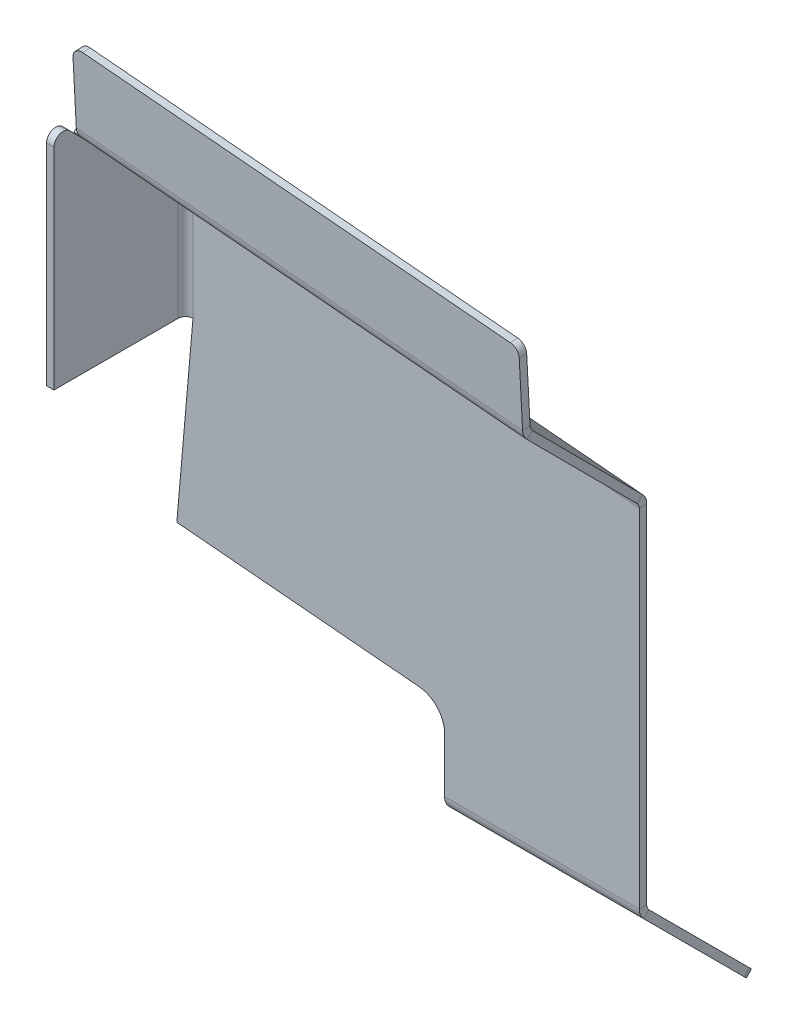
ISO-10303-21;
HEADER;
FILE_DESCRIPTION(('STEP AP214'),'2;1');
FILE_NAME('part.step','',(''),(''),'','','');
FILE_SCHEMA(('AUTOMOTIVE_DESIGN { 1 0 10303 214 1 1 1 1 }'));
ENDSEC;
DATA;
#1=APPLICATION_CONTEXT('core data for automotive mechanical design processes');
#2=APPLICATION_PROTOCOL_DEFINITION('international standard','automotive_design',2000,#1);
#3=PRODUCT_CONTEXT('',#1,'mechanical');
#4=PRODUCT('Part','Part','',(#3));
#5=PRODUCT_RELATED_PRODUCT_CATEGORY('part','',(#4));
#6=PRODUCT_DEFINITION_FORMATION('','',#4);
#7=PRODUCT_DEFINITION_CONTEXT('part definition',#1,'design');
#8=PRODUCT_DEFINITION('design','',#6,#7);
#9=PRODUCT_DEFINITION_SHAPE('','',#8);
#10=(LENGTH_UNIT() NAMED_UNIT(*) SI_UNIT(.MILLI.,.METRE.));
#11=(NAMED_UNIT(*) PLANE_ANGLE_UNIT() SI_UNIT($,.RADIAN.));
#12=(NAMED_UNIT(*) SI_UNIT($,.STERADIAN.) SOLID_ANGLE_UNIT());
#13=UNCERTAINTY_MEASURE_WITH_UNIT(LENGTH_MEASURE(1.E-05),#10,'distance_accuracy_value','');
#14=(GEOMETRIC_REPRESENTATION_CONTEXT(3) GLOBAL_UNCERTAINTY_ASSIGNED_CONTEXT((#13)) GLOBAL_UNIT_ASSIGNED_CONTEXT((#10,
#11,#12)) REPRESENTATION_CONTEXT('',''));
#15=CARTESIAN_POINT('',(0.,0.,0.));
#16=DIRECTION('',(0.,0.,1.));
#17=DIRECTION('',(1.,0.,0.));
#18=AXIS2_PLACEMENT_3D('',#15,#16,#17);
#19=CARTESIAN_POINT('',(21.,16.4811261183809,-12.0784598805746));
#20=DIRECTION('',(0.998099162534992,-0.0434947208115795,0.0436608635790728));
#21=DIRECTION('',(0.,0.708453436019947,0.705757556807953));
#22=AXIS2_PLACEMENT_3D('',#19,#20,#21);
#23=PLANE('',#22);
#24=CARTESIAN_POINT('',(21.049302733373,29.9063761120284,0.168629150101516));
#25=CARTESIAN_POINT('',(21.,29.3428432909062,0.734314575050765));
#26=B_SPLINE_CURVE_WITH_KNOTS('',1,(#24,#25),.UNSPECIFIED.,.F.,.F.,(2,2),(0.,1.),.UNSPECIFIED.);
#27=CARTESIAN_POINT('',(21.049302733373,29.9063761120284,0.168629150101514));
#28=VERTEX_POINT('',#27);
#29=CARTESIAN_POINT('',(21.,29.3428432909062,0.734314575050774));
#30=VERTEX_POINT('',#29);
#31=EDGE_CURVE('E423',#28,#30,#26,.T.);
#32=ORIENTED_EDGE('',*,*,#31,.F.);
#33=DIRECTION('',(0.,-0.708453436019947,-0.705757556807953));
#34=VECTOR('',#33,1.);
#35=CARTESIAN_POINT('',(21.049302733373,29.5258795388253,-0.210419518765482));
#36=LINE('',#35,#34);
#37=CARTESIAN_POINT('',(21.049302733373,41.8378963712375,12.0547463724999));
#38=VERTEX_POINT('',#37);
#39=EDGE_CURVE('E1302',#28,#38,#36,.F.);
#40=ORIENTED_EDGE('',*,*,#39,.T.);
#41=DIRECTION('',(-0.0616284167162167,-0.704416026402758,0.707106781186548));
#42=VECTOR('',#41,1.);
#43=CARTESIAN_POINT('',(21.,41.2743635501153,12.6204317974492));
#44=LINE('',#43,#42);
#45=CARTESIAN_POINT('',(21.,41.2743635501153,12.6204317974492));
#46=VERTEX_POINT('',#45);
#47=EDGE_CURVE('E1288',#38,#46,#44,.T.);
#48=ORIENTED_EDGE('',*,*,#47,.T.);
#49=DIRECTION('',(0.,0.708453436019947,0.705757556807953));
#50=VECTOR('',#49,1.);
#51=CARTESIAN_POINT('',(21.,16.4811261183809,-12.0784598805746));
#52=LINE('',#51,#50);
#53=EDGE_CURVE('E1296',#30,#46,#52,.T.);
#54=ORIENTED_EDGE('',*,*,#53,.F.);
#55=EDGE_LOOP('',(#32,#40,#48,#54));
#56=FACE_BOUND('',#55,.T.);
#57=ADVANCED_FACE('F82',(#56),#23,.T.);
#58=CARTESIAN_POINT('',(21.,44.016167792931,11.4890609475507));
#59=CARTESIAN_POINT('',(20.9767584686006,43.7505158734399,11.4890609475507));
#60=CARTESIAN_POINT('',(20.9535169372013,43.4848639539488,11.4890609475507));
#61=CARTESIAN_POINT('',(20.9302754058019,43.2192120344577,11.4890609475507));
#62=CARTESIAN_POINT('',(21.,44.016167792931,8.28906094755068));
#63=CARTESIAN_POINT('',(20.9767584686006,43.7505158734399,8.82239428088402));
#64=CARTESIAN_POINT('',(20.9535169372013,43.4848639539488,9.35572761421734));
#65=CARTESIAN_POINT('',(20.9302754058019,43.2192120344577,9.88906094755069));
#66=CARTESIAN_POINT('',(21.,40.8039443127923,8.28906094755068));
#67=CARTESIAN_POINT('',(21.0232415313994,41.0695962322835,8.82239428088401));
#68=CARTESIAN_POINT('',(21.0464830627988,41.3352481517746,9.35572761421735));
#69=CARTESIAN_POINT('',(21.0697245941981,41.6009000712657,9.88906094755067));
#70=CARTESIAN_POINT('',(21.,40.8039443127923,11.4890609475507));
#71=CARTESIAN_POINT('',(21.0232415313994,41.0695962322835,11.4890609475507));
#72=CARTESIAN_POINT('',(21.0464830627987,41.3352481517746,11.4890609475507));
#73=CARTESIAN_POINT('',(21.0697245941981,41.6009000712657,11.4890609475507));
#74=CARTESIAN_POINT('',(21.,40.8039443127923,14.6890609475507));
#75=CARTESIAN_POINT('',(21.0232415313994,41.0695962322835,14.1557276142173));
#76=CARTESIAN_POINT('',(21.0464830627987,41.3352481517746,13.622394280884));
#77=CARTESIAN_POINT('',(21.0697245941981,41.6009000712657,13.0890609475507));
#78=CARTESIAN_POINT('',(21.,44.016167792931,14.6890609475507));
#79=CARTESIAN_POINT('',(20.9767584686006,43.7505158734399,14.1557276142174));
#80=CARTESIAN_POINT('',(20.9535169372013,43.4848639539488,13.622394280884));
#81=CARTESIAN_POINT('',(20.9302754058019,43.2192120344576,13.0890609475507));
#82=CARTESIAN_POINT('',(21.,44.016167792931,11.4890609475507));
#83=CARTESIAN_POINT('',(20.9767584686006,43.7505158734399,11.4890609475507));
#84=CARTESIAN_POINT('',(20.9535169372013,43.4848639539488,11.4890609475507));
#85=CARTESIAN_POINT('',(20.9302754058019,43.2192120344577,11.4890609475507));
#86=(BOUNDED_SURFACE() B_SPLINE_SURFACE(3,3,((#58,#59,#60,#61),(#62,#63,#64,#65),(#66,#67,#68,
#69),(#70,#71,#72,#73),(#74,#75,#76,#77),(#78,#79,#80,#81),(#82,#83,#84,#85)),.UNSPECIFIED.,.T.,
.F.,.F.) B_SPLINE_SURFACE_WITH_KNOTS((4,3,4),(4,4),(0.,0.5,1.),(0.,1.),
.UNSPECIFIED.) GEOMETRIC_REPRESENTATION_ITEM() RATIONAL_B_SPLINE_SURFACE(((1.,1.,1.,1.),
(0.333333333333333,0.333333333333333,0.333333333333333,0.333333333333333),(0.333333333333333,
0.333333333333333,0.333333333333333,0.333333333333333),(1.,1.,1.,1.),(0.333333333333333,
0.333333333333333,0.333333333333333,0.333333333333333),(0.333333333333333,0.333333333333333,
0.333333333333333,0.333333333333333),(1.,1.,1.,1.))) REPRESENTATION_ITEM('') SURFACE());
#87=CARTESIAN_POINT('',(21.,42.4100560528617,11.4890609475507));
#88=DIRECTION('',(0.996307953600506,0.0858513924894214,0.));
#89=DIRECTION('',(-0.0858513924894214,0.996307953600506,0.));
#90=AXIS2_PLACEMENT_3D('',#87,#88,#89);
#91=ELLIPSE('',#90,0.812154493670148,0.8);
#92=CARTESIAN_POINT('',(21.003649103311,42.3677081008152,12.2879645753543));
#93=VERTEX_POINT('',#92);
#94=EDGE_CURVE('E1273',#38,#93,#91,.F.);
#95=DIRECTION('',(-0.00456137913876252,-0.0521368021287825,0.998629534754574));
#96=VECTOR('',#95,1.);
#97=CARTESIAN_POINT('',(21.,42.3259986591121,13.086868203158));
#98=LINE('',#97,#96);
#99=CARTESIAN_POINT('',(21.,42.3259986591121,13.086868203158));
#100=VERTEX_POINT('',#99);
#101=EDGE_CURVE('E1290',#93,#100,#98,.T.);
#102=CARTESIAN_POINT('',(21.,42.4100560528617,11.4890609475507));
#103=DIRECTION('',(1.,0.,0.));
#104=DIRECTION('',(0.,1.,0.));
#105=AXIS2_PLACEMENT_3D('',#102,#103,#104);
#106=ELLIPSE('',#105,1.60611174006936,1.6);
#107=EDGE_CURVE('E1299',#46,#100,#106,.F.);
#108=ORIENTED_EDGE('',*,*,#47,.F.);
#109=ORIENTED_EDGE('',*,*,#94,.T.);
#110=ORIENTED_EDGE('',*,*,#101,.T.);
#111=ORIENTED_EDGE('',*,*,#107,.F.);
#112=EDGE_LOOP('',(#108,#109,#110,#111));
#113=FACE_BOUND('',#112,.T.);
#114=ADVANCED_FACE('F389',(#113),#86,.F.);
#115=CARTESIAN_POINT('',(21.,-8.8389701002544,10.4156295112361));
#116=DIRECTION('',(0.999989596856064,-0.000237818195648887,0.00455517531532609));
#117=DIRECTION('',(0.,0.998639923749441,0.0521373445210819));
#118=AXIS2_PLACEMENT_3D('',#115,#116,#117);
#119=PLANE('',#118);
#120=DIRECTION('',(0.,-0.998639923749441,-0.0521373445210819));
#121=VECTOR('',#120,1.);
#122=CARTESIAN_POINT('',(21.003649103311,41.3678697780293,12.2357646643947));
#123=LINE('',#122,#121);
#124=CARTESIAN_POINT('',(21.003649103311,49.3393821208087,12.6519441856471));
#125=VERTEX_POINT('',#124);
#126=EDGE_CURVE('E1304',#93,#125,#123,.F.);
#127=ORIENTED_EDGE('',*,*,#126,.T.);
#128=DIRECTION('',(-0.00456137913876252,-0.0521368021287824,0.998629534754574));
#129=VECTOR('',#128,1.);
#130=CARTESIAN_POINT('',(21.,49.2976726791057,13.4508478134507));
#131=LINE('',#130,#129);
#132=CARTESIAN_POINT('',(21.,49.2976726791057,13.4508478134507));
#133=VERTEX_POINT('',#132);
#134=EDGE_CURVE('E461',#125,#133,#131,.T.);
#135=ORIENTED_EDGE('',*,*,#134,.T.);
#136=DIRECTION('',(0.,0.998639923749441,0.0521373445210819));
#137=VECTOR('',#136,1.);
#138=CARTESIAN_POINT('',(21.,-8.8389701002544,10.4156295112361));
#139=LINE('',#138,#137);
#140=EDGE_CURVE('E1298',#100,#133,#139,.T.);
#141=ORIENTED_EDGE('',*,*,#140,.F.);
#142=ORIENTED_EDGE('',*,*,#101,.F.);
#143=EDGE_LOOP('',(#127,#135,#141,#142));
#144=FACE_BOUND('',#143,.T.);
#145=ADVANCED_FACE('F385',(#144),#119,.T.);
#146=CARTESIAN_POINT('',(26.1411032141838,49.7630786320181,13.4986285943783));
#147=DIRECTION('',(0.0870362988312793,0.994829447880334,0.052335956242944));
#148=DIRECTION('',(-0.996194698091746,0.0871557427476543,0.));
#149=AXIS2_PLACEMENT_3D('',#146,#147,#148);
#150=PLANE('',#149);
#151=DIRECTION('',(-0.996194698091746,0.0871557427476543,0.));
#152=VECTOR('',#151,1.);
#153=CARTESIAN_POINT('',(26.1447523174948,49.8047880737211,12.6997249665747));
#154=LINE('',#153,#152);
#155=CARTESIAN_POINT('',(20.0906958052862,50.3344493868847,12.6997249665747));
#156=VERTEX_POINT('',#155);
#157=CARTESIAN_POINT('',(-26.0558563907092,54.3717495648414,12.6997249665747));
#158=VERTEX_POINT('',#157);
#159=EDGE_CURVE('E1307',#156,#158,#154,.T.);
#160=ORIENTED_EDGE('',*,*,#159,.T.);
#161=DIRECTION('',(-0.00456137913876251,-0.0521368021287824,0.998629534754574));
#162=VECTOR('',#161,1.);
#163=CARTESIAN_POINT('',(-26.0595054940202,54.3300401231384,13.4986285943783));
#164=LINE('',#163,#162);
#165=CARTESIAN_POINT('',(-26.0595054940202,54.3300401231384,13.4986285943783));
#166=VERTEX_POINT('',#165);
#167=EDGE_CURVE('E448',#158,#166,#164,.T.);
#168=ORIENTED_EDGE('',*,*,#167,.T.);
#169=DIRECTION('',(-0.996194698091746,0.0871557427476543,0.));
#170=VECTOR('',#169,1.);
#171=CARTESIAN_POINT('',(26.1411032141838,49.7630786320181,13.4986285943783));
#172=LINE('',#171,#170);
#173=CARTESIAN_POINT('',(20.0870467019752,50.2927399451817,13.4986285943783));
#174=VERTEX_POINT('',#173);
#175=EDGE_CURVE('E1323',#174,#166,#172,.T.);
#176=ORIENTED_EDGE('',*,*,#175,.F.);
#177=DIRECTION('',(-0.00456137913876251,-0.0521368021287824,0.998629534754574));
#178=VECTOR('',#177,1.);
#179=CARTESIAN_POINT('',(20.0870467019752,50.2927399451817,13.4986285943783));
#180=LINE('',#179,#178);
#181=EDGE_CURVE('E446',#174,#156,#180,.F.);
#182=ORIENTED_EDGE('',*,*,#181,.T.);
#183=EDGE_LOOP('',(#160,#168,#176,#182));
#184=FACE_BOUND('',#183,.T.);
#185=ADVANCED_FACE('F381',(#184),#150,.T.);
#186=CARTESIAN_POINT('',(-27.1465313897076,54.4514105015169,13.5));
#187=DIRECTION('',(-0.999989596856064,0.000237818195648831,-0.00455517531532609));
#188=DIRECTION('',(0.,-0.998639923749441,-0.0521373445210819));
#189=AXIS2_PLACEMENT_3D('',#186,#187,#188);
#190=PLANE('',#189);
#191=DIRECTION('',(0.,-0.998639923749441,-0.0521373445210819));
#192=VECTOR('',#191,1.);
#193=CARTESIAN_POINT('',(-27.1465313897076,54.4514105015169,13.5));
#194=LINE('',#193,#192);
#195=CARTESIAN_POINT('',(-27.1465313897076,53.3354484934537,13.4417374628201));
#196=VERTEX_POINT('',#195);
#197=CARTESIAN_POINT('',(-27.1465313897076,46.5382743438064,13.086868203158));
#198=VERTEX_POINT('',#197);
#199=EDGE_CURVE('E1327',#196,#198,#194,.T.);
#200=ORIENTED_EDGE('',*,*,#199,.F.);
#201=DIRECTION('',(-0.00456137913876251,-0.0521368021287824,0.998629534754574));
#202=VECTOR('',#201,1.);
#203=CARTESIAN_POINT('',(-27.1465313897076,53.3354484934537,13.4417374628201));
#204=LINE('',#203,#202);
#205=CARTESIAN_POINT('',(-27.1428822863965,53.3771579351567,12.6428338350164));
#206=VERTEX_POINT('',#205);
#207=EDGE_CURVE('E455',#196,#206,#204,.F.);
#208=ORIENTED_EDGE('',*,*,#207,.T.);
#209=DIRECTION('',(0.,-0.998639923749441,-0.0521373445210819));
#210=VECTOR('',#209,1.);
#211=CARTESIAN_POINT('',(-27.1428822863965,41.3793200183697,12.0164464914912));
#212=LINE('',#211,#210);
#213=CARTESIAN_POINT('',(-27.1428822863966,46.5799837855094,12.2879645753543));
#214=VERTEX_POINT('',#213);
#215=EDGE_CURVE('E1336',#206,#214,#212,.T.);
#216=ORIENTED_EDGE('',*,*,#215,.T.);
#217=DIRECTION('',(-0.00456137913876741,-0.0521368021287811,0.998629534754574));
#218=VECTOR('',#217,1.);
#219=CARTESIAN_POINT('',(-27.1465313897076,46.5382743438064,13.086868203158));
#220=LINE('',#219,#218);
#221=EDGE_CURVE('E1270',#214,#198,#220,.T.);
#222=ORIENTED_EDGE('',*,*,#221,.T.);
#223=EDGE_LOOP('',(#200,#208,#216,#222));
#224=FACE_BOUND('',#223,.T.);
#225=ADVANCED_FACE('F378',(#224),#190,.T.);
#226=CARTESIAN_POINT('',(-27.1465313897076,48.2284434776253,11.4890609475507));
#227=CARTESIAN_POINT('',(-27.1697729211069,47.9627915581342,11.4890609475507));
#228=CARTESIAN_POINT('',(-27.1930144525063,47.697139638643,11.4890609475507));
#229=CARTESIAN_POINT('',(-27.2162559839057,47.4314877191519,11.4890609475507));
#230=CARTESIAN_POINT('',(-27.1465313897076,48.2284434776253,14.6890609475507));
#231=CARTESIAN_POINT('',(-27.1697729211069,47.9627915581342,14.1557276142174));
#232=CARTESIAN_POINT('',(-27.1930144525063,47.6971396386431,13.622394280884));
#233=CARTESIAN_POINT('',(-27.2162559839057,47.4314877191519,13.0890609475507));
#234=CARTESIAN_POINT('',(-27.1465313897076,45.0162199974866,14.6890609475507));
#235=CARTESIAN_POINT('',(-27.1232898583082,45.2818719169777,14.1557276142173));
#236=CARTESIAN_POINT('',(-27.1000483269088,45.5475238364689,13.622394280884));
#237=CARTESIAN_POINT('',(-27.0768067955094,45.81317575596,13.0890609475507));
#238=CARTESIAN_POINT('',(-27.1465313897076,45.0162199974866,11.4890609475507));
#239=CARTESIAN_POINT('',(-27.1232898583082,45.2818719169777,11.4890609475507));
#240=CARTESIAN_POINT('',(-27.1000483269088,45.5475238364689,11.4890609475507));
#241=CARTESIAN_POINT('',(-27.0768067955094,45.81317575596,11.4890609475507));
#242=CARTESIAN_POINT('',(-27.1465313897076,45.0162199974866,8.28906094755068));
#243=CARTESIAN_POINT('',(-27.1232898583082,45.2818719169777,8.82239428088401));
#244=CARTESIAN_POINT('',(-27.1000483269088,45.5475238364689,9.35572761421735));
#245=CARTESIAN_POINT('',(-27.0768067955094,45.81317575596,9.88906094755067));
#246=CARTESIAN_POINT('',(-27.1465313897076,48.2284434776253,8.28906094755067));
#247=CARTESIAN_POINT('',(-27.1697729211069,47.9627915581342,8.822394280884));
#248=CARTESIAN_POINT('',(-27.1930144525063,47.6971396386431,9.35572761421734));
#249=CARTESIAN_POINT('',(-27.2162559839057,47.4314877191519,9.88906094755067));
#250=CARTESIAN_POINT('',(-27.1465313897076,48.2284434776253,11.4890609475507));
#251=CARTESIAN_POINT('',(-27.1697729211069,47.9627915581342,11.4890609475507));
#252=CARTESIAN_POINT('',(-27.1930144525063,47.697139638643,11.4890609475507));
#253=CARTESIAN_POINT('',(-27.2162559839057,47.4314877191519,11.4890609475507));
#254=(BOUNDED_SURFACE() B_SPLINE_SURFACE(3,3,((#226,#227,#228,#229),(#230,#231,#232,#233),(#234,
#235,#236,#237),(#238,#239,#240,#241),(#242,#243,#244,#245),(#246,#247,#248,#249),(#250,#251,
#252,#253)),.UNSPECIFIED.,.T.,.F.,.F.) B_SPLINE_SURFACE_WITH_KNOTS((4,3,4),(4,4),(0.,0.5,1.),
(0.,1.),.UNSPECIFIED.) GEOMETRIC_REPRESENTATION_ITEM() RATIONAL_B_SPLINE_SURFACE(((1.,1.,1.,1.),
(0.333333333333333,0.333333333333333,0.333333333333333,0.333333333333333),(0.333333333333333,
0.333333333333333,0.333333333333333,0.333333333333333),(1.,1.,1.,1.),(0.333333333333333,
0.333333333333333,0.333333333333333,0.333333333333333),(0.333333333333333,0.333333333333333,
0.333333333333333,0.333333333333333),(1.,1.,1.,1.))) REPRESENTATION_ITEM('') SURFACE());
#255=CARTESIAN_POINT('',(-27.1465313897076,46.622331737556,11.4890609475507));
#256=DIRECTION('',(-0.996307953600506,-0.0858513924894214,0.));
#257=DIRECTION('',(-0.0858513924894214,0.996307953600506,0.));
#258=AXIS2_PLACEMENT_3D('',#255,#256,#257);
#259=ELLIPSE('',#258,0.812154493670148,0.8);
#260=CARTESIAN_POINT('',(-27.0972286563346,46.0501720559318,12.0547463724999));
#261=VERTEX_POINT('',#260);
#262=EDGE_CURVE('E316',#214,#261,#259,.F.);
#263=DIRECTION('',(-0.0616284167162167,-0.70441602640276,0.707106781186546));
#264=VECTOR('',#263,1.);
#265=CARTESIAN_POINT('',(-27.1465313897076,45.4866392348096,12.6204317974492));
#266=LINE('',#265,#264);
#267=CARTESIAN_POINT('',(-27.1465313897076,45.4866392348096,12.6204317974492));
#268=VERTEX_POINT('',#267);
#269=EDGE_CURVE('E291',#261,#268,#266,.T.);
#270=CARTESIAN_POINT('',(-27.1465313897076,46.622331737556,11.4890609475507));
#271=DIRECTION('',(-1.,0.,0.));
#272=DIRECTION('',(0.,1.,0.));
#273=AXIS2_PLACEMENT_3D('',#270,#271,#272);
#274=ELLIPSE('',#273,1.60611174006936,1.6);
#275=EDGE_CURVE('E1319',#198,#268,#274,.F.);
#276=ORIENTED_EDGE('',*,*,#262,.T.);
#277=ORIENTED_EDGE('',*,*,#269,.T.);
#278=ORIENTED_EDGE('',*,*,#275,.F.);
#279=ORIENTED_EDGE('',*,*,#221,.F.);
#280=EDGE_LOOP('',(#276,#277,#278,#279));
#281=FACE_BOUND('',#280,.T.);
#282=ADVANCED_FACE('F362',(#281),#254,.F.);
#283=CARTESIAN_POINT('',(25.4028768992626,41.3251132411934,13.0547243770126));
#284=DIRECTION('',(-0.00456137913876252,-0.0521368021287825,0.998629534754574));
#285=DIRECTION('',(0.,-0.998639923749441,-0.0521373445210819));
#286=AXIS2_PLACEMENT_3D('',#283,#284,#285);
#287=PLANE('',#286);
#288=ORIENTED_EDGE('',*,*,#175,.T.);
#289=CARTESIAN_POINT('',(-26.1465417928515,53.3352106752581,13.4462926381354));
#290=DIRECTION('',(-0.00456137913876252,-0.0521368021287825,0.998629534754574));
#291=DIRECTION('',(0.,-0.998639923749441,-0.052137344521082));
#292=AXIS2_PLACEMENT_3D('',#289,#290,#291);
#293=CIRCLE('',#292,1.);
#294=EDGE_CURVE('E453',#166,#196,#293,.T.);
#295=ORIENTED_EDGE('',*,*,#294,.T.);
#296=ORIENTED_EDGE('',*,*,#199,.T.);
#297=DIRECTION('',(-0.996194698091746,0.0871557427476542,0.));
#298=VECTOR('',#297,1.);
#299=CARTESIAN_POINT('',(25.4563330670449,41.93612003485,13.086868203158));
#300=LINE('',#299,#298);
#301=EDGE_CURVE('E1295',#198,#100,#300,.F.);
#302=ORIENTED_EDGE('',*,*,#301,.T.);
#303=ORIENTED_EDGE('',*,*,#140,.T.);
#304=CARTESIAN_POINT('',(20.0000104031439,49.2979104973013,13.4462926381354));
#305=DIRECTION('',(-0.00456137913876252,-0.0521368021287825,0.998629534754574));
#306=DIRECTION('',(0.,-0.998639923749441,-0.052137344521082));
#307=AXIS2_PLACEMENT_3D('',#304,#305,#306);
#308=CIRCLE('',#307,1.);
#309=EDGE_CURVE('E451',#133,#174,#308,.T.);
#310=ORIENTED_EDGE('',*,*,#309,.T.);
#311=EDGE_LOOP('',(#288,#295,#296,#302,#303,#310));
#312=FACE_BOUND('',#311,.T.);
#313=ADVANCED_FACE('F359',(#312),#287,.T.);
#314=CARTESIAN_POINT('',(24.308660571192,28.8181633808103,0.500000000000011));
#315=DIRECTION('',(-0.0616284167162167,-0.70441602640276,0.707106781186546));
#316=DIRECTION('',(0.,-0.708453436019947,-0.705757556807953));
#317=AXIS2_PLACEMENT_3D('',#314,#315,#316);
#318=PLANE('',#317);
#319=DIRECTION('',(-0.996194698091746,0.0871557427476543,0.));
#320=VECTOR('',#319,1.);
#321=CARTESIAN_POINT('',(25.365025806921,40.8924732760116,12.6204317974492));
#322=LINE('',#321,#320);
#323=EDGE_CURVE('E1318',#46,#268,#322,.T.);
#324=ORIENTED_EDGE('',*,*,#323,.T.);
#325=DIRECTION('',(0.996194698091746,-0.0871557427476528,0.));
#326=VECTOR('',#325,1.);
#327=CARTESIAN_POINT('',(-27.8736743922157,45.5502560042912,12.6204317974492));
#328=LINE('',#327,#326);
#329=CARTESIAN_POINT('',(-27.8736743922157,45.5502560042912,12.6204317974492));
#330=VERTEX_POINT('',#329);
#331=EDGE_CURVE('E1287',#330,#268,#328,.T.);
#332=ORIENTED_EDGE('',*,*,#331,.F.);
#333=DIRECTION('',(0.,0.708453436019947,0.705757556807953));
#334=VECTOR('',#333,1.);
#335=CARTESIAN_POINT('',(-27.8736743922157,33.6187357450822,0.734314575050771));
#336=LINE('',#335,#334);
#337=CARTESIAN_POINT('',(-27.8736743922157,34.0726928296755,1.18654421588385));
#338=VERTEX_POINT('',#337);
#339=EDGE_CURVE('E313',#338,#330,#336,.T.);
#340=ORIENTED_EDGE('',*,*,#339,.F.);
#341=DIRECTION('',(0.403247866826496,-0.66563174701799,-0.627953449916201));
#342=VECTOR('',#341,1.);
#343=CARTESIAN_POINT('',(-14.944031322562,12.7300358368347,-18.9480048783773));
#344=LINE('',#343,#342);
#345=CARTESIAN_POINT('',(-27.5832696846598,33.5933286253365,0.734314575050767));
#346=VERTEX_POINT('',#345);
#347=EDGE_CURVE('E309',#338,#346,#344,.T.);
#348=ORIENTED_EDGE('',*,*,#347,.T.);
#349=DIRECTION('',(0.996194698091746,-0.0871557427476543,0.));
#350=VECTOR('',#349,1.);
#351=CARTESIAN_POINT('',(21.0204218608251,29.3410566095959,0.734314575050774));
#352=LINE('',#351,#350);
#353=EDGE_CURVE('E277',#346,#30,#352,.T.);
#354=ORIENTED_EDGE('',*,*,#353,.T.);
#355=ORIENTED_EDGE('',*,*,#53,.T.);
#356=EDGE_LOOP('',(#324,#332,#340,#348,#354,#355));
#357=FACE_BOUND('',#356,.T.);
#358=ADVANCED_FACE('F311',(#357),#318,.T.);
#359=CARTESIAN_POINT('',(25.4636312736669,42.0195389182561,11.4890609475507));
#360=DIRECTION('',(-0.996194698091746,0.0871557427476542,0.));
#361=DIRECTION('',(-0.0871557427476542,-0.996194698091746,0.));
#362=AXIS2_PLACEMENT_3D('',#359,#360,#361);
#363=CYLINDRICAL_SURFACE('',#362,1.6);
#364=ORIENTED_EDGE('',*,*,#107,.T.);
#365=ORIENTED_EDGE('',*,*,#301,.F.);
#366=ORIENTED_EDGE('',*,*,#275,.T.);
#367=ORIENTED_EDGE('',*,*,#323,.F.);
#368=EDGE_LOOP('',(#364,#365,#366,#367));
#369=FACE_BOUND('',#368,.T.);
#370=ADVANCED_FACE('F358',(#369),#363,.T.);
#371=CARTESIAN_POINT('',(25.4065260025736,41.3668226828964,12.255820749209));
#372=DIRECTION('',(-0.00456137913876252,-0.0521368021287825,0.998629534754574));
#373=DIRECTION('',(0.,-0.998639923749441,-0.0521373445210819));
#374=AXIS2_PLACEMENT_3D('',#371,#372,#373);
#375=PLANE('',#374);
#376=ORIENTED_EDGE('',*,*,#215,.F.);
#377=CARTESIAN_POINT('',(-26.1428926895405,53.3769201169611,12.6473890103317));
#378=DIRECTION('',(-0.00456137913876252,-0.0521368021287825,0.998629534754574));
#379=DIRECTION('',(0.,-0.998639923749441,-0.052137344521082));
#380=AXIS2_PLACEMENT_3D('',#377,#378,#379);
#381=CIRCLE('',#380,1.);
#382=EDGE_CURVE('E459',#206,#158,#381,.F.);
#383=ORIENTED_EDGE('',*,*,#382,.T.);
#384=ORIENTED_EDGE('',*,*,#159,.F.);
#385=CARTESIAN_POINT('',(20.0036595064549,49.3396199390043,12.6473890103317));
#386=DIRECTION('',(-0.00456137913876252,-0.0521368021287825,0.998629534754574));
#387=DIRECTION('',(0.,-0.998639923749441,-0.052137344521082));
#388=AXIS2_PLACEMENT_3D('',#385,#386,#387);
#389=CIRCLE('',#388,1.);
#390=EDGE_CURVE('E457',#156,#125,#389,.F.);
#391=ORIENTED_EDGE('',*,*,#390,.T.);
#392=ORIENTED_EDGE('',*,*,#126,.F.);
#393=DIRECTION('',(-0.996194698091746,0.0871557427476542,0.));
#394=VECTOR('',#393,1.);
#395=CARTESIAN_POINT('',(25.4599821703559,41.977829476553,12.2879645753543));
#396=LINE('',#395,#394);
#397=EDGE_CURVE('E1332',#214,#93,#396,.F.);
#398=ORIENTED_EDGE('',*,*,#397,.F.);
#399=EDGE_LOOP('',(#376,#383,#384,#391,#392,#398));
#400=FACE_BOUND('',#399,.T.);
#401=ADVANCED_FACE('F366',(#400),#375,.F.);
#402=CARTESIAN_POINT('',(24.357963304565,29.3816962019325,-0.0656854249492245));
#403=DIRECTION('',(-0.0616284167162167,-0.70441602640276,0.707106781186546));
#404=DIRECTION('',(0.,-0.708453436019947,-0.705757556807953));
#405=AXIS2_PLACEMENT_3D('',#402,#403,#404);
#406=PLANE('',#405);
#407=DIRECTION('',(0.996194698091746,-0.0871557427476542,0.));
#408=VECTOR('',#407,1.);
#409=CARTESIAN_POINT('',(24.3783851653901,29.6151191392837,0.168629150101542));
#410=LINE('',#409,#408);
#411=CARTESIAN_POINT('',(-27.5339669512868,34.1568614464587,0.168629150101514));
#412=VERTEX_POINT('',#411);
#413=EDGE_CURVE('E325',#412,#28,#410,.T.);
#414=ORIENTED_EDGE('',*,*,#413,.F.);
#415=DIRECTION('',(-0.403247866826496,0.66563174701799,0.627953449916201));
#416=VECTOR('',#415,1.);
#417=CARTESIAN_POINT('',(-6.54891696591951,-0.482665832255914,-32.5101166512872));
#418=LINE('',#417,#416);
#419=CARTESIAN_POINT('',(-27.8243716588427,34.6362256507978,0.620858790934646));
#420=VERTEX_POINT('',#419);
#421=EDGE_CURVE('E323',#412,#420,#418,.T.);
#422=ORIENTED_EDGE('',*,*,#421,.T.);
#423=DIRECTION('',(0.,0.708453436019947,0.705757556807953));
#424=VECTOR('',#423,1.);
#425=CARTESIAN_POINT('',(-27.8243716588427,34.1822685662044,0.168629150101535));
#426=LINE('',#425,#424);
#427=CARTESIAN_POINT('',(-27.8243716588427,46.1137888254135,12.0547463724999));
#428=VERTEX_POINT('',#427);
#429=EDGE_CURVE('E1282',#420,#428,#426,.T.);
#430=ORIENTED_EDGE('',*,*,#429,.T.);
#431=DIRECTION('',(0.996194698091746,-0.0871557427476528,0.));
#432=VECTOR('',#431,1.);
#433=CARTESIAN_POINT('',(-27.8243716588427,46.1137888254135,12.0547463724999));
#434=LINE('',#433,#432);
#435=EDGE_CURVE('E1277',#428,#261,#434,.T.);
#436=ORIENTED_EDGE('',*,*,#435,.T.);
#437=DIRECTION('',(-0.996194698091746,0.0871557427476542,0.));
#438=VECTOR('',#437,1.);
#439=CARTESIAN_POINT('',(25.4143285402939,41.4560060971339,12.0547463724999));
#440=LINE('',#439,#438);
#441=EDGE_CURVE('E1279',#38,#261,#440,.T.);
#442=ORIENTED_EDGE('',*,*,#441,.F.);
#443=ORIENTED_EDGE('',*,*,#39,.F.);
#444=EDGE_LOOP('',(#414,#422,#430,#436,#442,#443));
#445=FACE_BOUND('',#444,.T.);
#446=ADVANCED_FACE('F370',(#445),#406,.F.);
#447=CARTESIAN_POINT('',(25.4636312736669,42.0195389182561,11.4890609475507));
#448=DIRECTION('',(-0.996194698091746,0.0871557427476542,0.));
#449=DIRECTION('',(-0.0871557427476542,-0.996194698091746,0.));
#450=AXIS2_PLACEMENT_3D('',#447,#448,#449);
#451=CYLINDRICAL_SURFACE('',#450,0.8);
#452=ORIENTED_EDGE('',*,*,#94,.F.);
#453=ORIENTED_EDGE('',*,*,#441,.T.);
#454=ORIENTED_EDGE('',*,*,#262,.F.);
#455=ORIENTED_EDGE('',*,*,#397,.T.);
#456=EDGE_LOOP('',(#452,#453,#454,#455));
#457=FACE_BOUND('',#456,.T.);
#458=ADVANCED_FACE('F354',(#457),#451,.F.);
#459=CARTESIAN_POINT('',(-27.8243716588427,34.1822685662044,0.168629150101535));
#460=DIRECTION('',(0.998099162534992,-0.0434947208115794,0.043660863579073));
#461=DIRECTION('',(0.,0.708453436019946,0.705757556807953));
#462=AXIS2_PLACEMENT_3D('',#459,#460,#461);
#463=PLANE('',#462);
#464=ORIENTED_EDGE('',*,*,#429,.F.);
#465=DIRECTION('',(-0.0616284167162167,-0.70441602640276,0.707106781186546));
#466=VECTOR('',#465,1.);
#467=CARTESIAN_POINT('',(-27.8243716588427,34.6362256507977,0.620858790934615));
#468=LINE('',#467,#466);
#469=EDGE_CURVE('E1350',#420,#338,#468,.T.);
#470=ORIENTED_EDGE('',*,*,#469,.T.);
#471=ORIENTED_EDGE('',*,*,#339,.T.);
#472=DIRECTION('',(-0.0616284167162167,-0.70441602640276,0.707106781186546));
#473=VECTOR('',#472,1.);
#474=CARTESIAN_POINT('',(-27.8243716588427,46.1137888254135,12.0547463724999));
#475=LINE('',#474,#473);
#476=EDGE_CURVE('E317',#428,#330,#475,.T.);
#477=ORIENTED_EDGE('',*,*,#476,.F.);
#478=EDGE_LOOP('',(#464,#470,#471,#477));
#479=FACE_BOUND('',#478,.T.);
#480=ADVANCED_FACE('F350',(#479),#463,.F.);
#481=CARTESIAN_POINT('',(-27.8243716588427,46.1137888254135,12.0547463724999));
#482=DIRECTION('',(-0.0616284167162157,-0.704416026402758,-0.707106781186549));
#483=DIRECTION('',(0.996194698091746,-0.0871557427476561,0.));
#484=AXIS2_PLACEMENT_3D('',#481,#482,#483);
#485=PLANE('',#484);
#486=ORIENTED_EDGE('',*,*,#331,.T.);
#487=ORIENTED_EDGE('',*,*,#269,.F.);
#488=ORIENTED_EDGE('',*,*,#435,.F.);
#489=ORIENTED_EDGE('',*,*,#476,.T.);
#490=EDGE_LOOP('',(#486,#487,#488,#489));
#491=FACE_BOUND('',#490,.T.);
#492=ADVANCED_FACE('F344',(#491),#485,.F.);
#493=CARTESIAN_POINT('',(-6.54891696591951,-0.482665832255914,-32.5101166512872));
#494=DIRECTION('',(0.913013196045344,0.246439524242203,0.325076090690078));
#495=DIRECTION('',(-0.403247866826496,0.665631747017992,0.6279534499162));
#496=AXIS2_PLACEMENT_3D('',#493,#494,#495);
#497=PLANE('',#496);
#498=ORIENTED_EDGE('',*,*,#347,.F.);
#499=ORIENTED_EDGE('',*,*,#469,.F.);
#500=ORIENTED_EDGE('',*,*,#421,.F.);
#501=CARTESIAN_POINT('',(-27.5832696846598,33.5933286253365,0.734314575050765));
#502=CARTESIAN_POINT('',(-27.5339669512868,34.1568614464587,0.168629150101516));
#503=B_SPLINE_CURVE_WITH_KNOTS('',1,(#501,#502),.UNSPECIFIED.,.F.,.F.,(2,2),(0.,1.),.UNSPECIFIED.);
#504=EDGE_CURVE('E290',#346,#412,#503,.T.);
#505=ORIENTED_EDGE('',*,*,#504,.F.);
#506=EDGE_LOOP('',(#498,#499,#500,#505));
#507=FACE_BOUND('',#506,.T.);
#508=ADVANCED_FACE('F321',(#507),#497,.F.);
#509=CARTESIAN_POINT('',(-28.7465313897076,22.4514105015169,14.7));
#510=DIRECTION('',(0.,1.,0.));
#511=DIRECTION('',(0.,0.,1.));
#512=AXIS2_PLACEMENT_3D('',#509,#510,#511);
#513=PLANE('',#512);
#514=DIRECTION('',(-1.,0.,0.));
#515=VECTOR('',#514,1.);
#516=CARTESIAN_POINT('',(-27.9465313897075,22.4514105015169,1.3));
#517=LINE('',#516,#515);
#518=CARTESIAN_POINT('',(-27.9465313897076,22.4514105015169,1.3));
#519=VERTEX_POINT('',#518);
#520=CARTESIAN_POINT('',(-28.7465313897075,22.4514105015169,1.3));
#521=VERTEX_POINT('',#520);
#522=EDGE_CURVE('E593',#519,#521,#517,.T.);
#523=ORIENTED_EDGE('',*,*,#522,.F.);
#524=DIRECTION('',(0.,0.,-1.));
#525=VECTOR('',#524,1.);
#526=CARTESIAN_POINT('',(-27.9465313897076,22.4514105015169,14.7));
#527=LINE('',#526,#525);
#528=CARTESIAN_POINT('',(-27.9465313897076,22.4514105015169,14.7));
#529=VERTEX_POINT('',#528);
#530=EDGE_CURVE('E620',#519,#529,#527,.F.);
#531=ORIENTED_EDGE('',*,*,#530,.T.);
#532=DIRECTION('',(1.,0.,0.));
#533=VECTOR('',#532,1.);
#534=CARTESIAN_POINT('',(-28.7465313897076,22.4514105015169,14.7));
#535=LINE('',#534,#533);
#536=CARTESIAN_POINT('',(-28.7465313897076,22.4514105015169,14.7));
#537=VERTEX_POINT('',#536);
#538=EDGE_CURVE('E601',#537,#529,#535,.T.);
#539=ORIENTED_EDGE('',*,*,#538,.F.);
#540=DIRECTION('',(0.,0.,1.));
#541=VECTOR('',#540,1.);
#542=CARTESIAN_POINT('',(-28.7465313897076,22.4514105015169,0.));
#543=LINE('',#542,#541);
#544=EDGE_CURVE('E599',#521,#537,#543,.T.);
#545=ORIENTED_EDGE('',*,*,#544,.F.);
#546=EDGE_LOOP('',(#523,#531,#539,#545));
#547=FACE_BOUND('',#546,.T.);
#548=ADVANCED_FACE('F343',(#547),#513,.F.);
#549=CARTESIAN_POINT('',(20.9999999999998,-21.35218613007,-11.5208152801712));
#550=DIRECTION('',(0.,0.707106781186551,0.707106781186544));
#551=DIRECTION('',(0.,-0.707106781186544,0.707106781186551));
#552=AXIS2_PLACEMENT_3D('',#549,#550,#551);
#553=PLANE('',#552);
#554=DIRECTION('',(1.,0.,0.));
#555=VECTOR('',#554,1.);
#556=CARTESIAN_POINT('',(20.9999999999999,-20.7865007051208,-12.0865007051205));
#557=LINE('',#556,#555);
#558=CARTESIAN_POINT('',(0.,-20.7865007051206,-12.0865007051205));
#559=VERTEX_POINT('',#558);
#560=CARTESIAN_POINT('',(19.9999999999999,-20.7865007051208,-12.0865007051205));
#561=VERTEX_POINT('',#560);
#562=EDGE_CURVE('E617',#559,#561,#557,.T.);
#563=ORIENTED_EDGE('',*,*,#562,.T.);
#564=DIRECTION('',(0.,0.707106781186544,-0.707106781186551));
#565=VECTOR('',#564,1.);
#566=CARTESIAN_POINT('',(19.9999999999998,-21.35218613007,-11.5208152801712));
#567=LINE('',#566,#565);
#568=CARTESIAN_POINT('',(19.9999999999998,-21.35218613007,-11.5208152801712));
#569=VERTEX_POINT('',#568);
#570=EDGE_CURVE('E439',#561,#569,#567,.F.);
#571=ORIENTED_EDGE('',*,*,#570,.T.);
#572=DIRECTION('',(1.,0.,0.));
#573=VECTOR('',#572,1.);
#574=CARTESIAN_POINT('',(20.9999999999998,-21.35218613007,-11.5208152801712));
#575=LINE('',#574,#573);
#576=CARTESIAN_POINT('',(0.,-21.3521861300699,-11.5208152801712));
#577=VERTEX_POINT('',#576);
#578=EDGE_CURVE('E577',#577,#569,#575,.T.);
#579=ORIENTED_EDGE('',*,*,#578,.F.);
#580=DIRECTION('',(0.,0.707106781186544,-0.707106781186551));
#581=VECTOR('',#580,1.);
#582=CARTESIAN_POINT('',(0.,-21.3521861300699,-11.5208152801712));
#583=LINE('',#582,#581);
#584=EDGE_CURVE('E614',#577,#559,#583,.T.);
#585=ORIENTED_EDGE('',*,*,#584,.T.);
#586=EDGE_LOOP('',(#563,#571,#579,#585));
#587=FACE_BOUND('',#586,.T.);
#588=ADVANCED_FACE('F807',(#587),#553,.F.);
#589=CARTESIAN_POINT('',(0.,-21.3521861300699,-11.5208152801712));
#590=DIRECTION('',(1.,0.,0.));
#591=DIRECTION('',(0.,1.,0.));
#592=AXIS2_PLACEMENT_3D('',#589,#590,#591);
#593=PLANE('',#592);
#594=DIRECTION('',(0.,-0.707106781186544,0.707106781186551));
#595=VECTOR('',#594,1.);
#596=CARTESIAN_POINT('',(0.,-9.23431457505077,-0.534314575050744));
#597=LINE('',#596,#595);
#598=CARTESIAN_POINT('',(0.,-9.23431457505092,-0.534314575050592));
#599=VERTEX_POINT('',#598);
#600=CARTESIAN_POINT('',(0.,-9.80000000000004,0.0313708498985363));
#601=VERTEX_POINT('',#600);
#602=EDGE_CURVE('E572',#599,#601,#597,.T.);
#603=ORIENTED_EDGE('',*,*,#602,.F.);
#604=DIRECTION('',(0.,-0.707106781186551,-0.707106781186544));
#605=VECTOR('',#604,1.);
#606=CARTESIAN_POINT('',(0.,-20.7865007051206,-12.0865007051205));
#607=LINE('',#606,#605);
#608=EDGE_CURVE('E612',#599,#559,#607,.T.);
#609=ORIENTED_EDGE('',*,*,#608,.T.);
#610=ORIENTED_EDGE('',*,*,#584,.F.);
#611=DIRECTION('',(0.,-0.707106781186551,-0.707106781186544));
#612=VECTOR('',#611,1.);
#613=CARTESIAN_POINT('',(0.,-21.3521861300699,-11.5208152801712));
#614=LINE('',#613,#612);
#615=EDGE_CURVE('E580',#601,#577,#614,.T.);
#616=ORIENTED_EDGE('',*,*,#615,.F.);
#617=EDGE_LOOP('',(#603,#609,#610,#616));
#618=FACE_BOUND('',#617,.T.);
#619=ADVANCED_FACE('F805',(#618),#593,.F.);
#620=CARTESIAN_POINT('',(21.,-9.56568542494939,0.265685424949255));
#621=DIRECTION('',(-1.,0.,0.));
#622=DIRECTION('',(0.,-1.,0.));
#623=AXIS2_PLACEMENT_3D('',#620,#621,#622);
#624=PLANE('',#623);
#625=DIRECTION('',(0.,0.707106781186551,0.707106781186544));
#626=VECTOR('',#625,1.);
#627=CARTESIAN_POINT('',(21.,-9.56568542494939,0.265685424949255));
#628=LINE('',#627,#626);
#629=CARTESIAN_POINT('',(20.9999999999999,-20.6450793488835,-10.8137084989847));
#630=VERTEX_POINT('',#629);
#631=CARTESIAN_POINT('',(21.,-9.80000000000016,0.0313708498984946));
#632=VERTEX_POINT('',#631);
#633=EDGE_CURVE('E575',#630,#632,#628,.T.);
#634=ORIENTED_EDGE('',*,*,#633,.F.);
#635=DIRECTION('',(0.,0.707106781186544,-0.707106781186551));
#636=VECTOR('',#635,1.);
#637=CARTESIAN_POINT('',(20.9999999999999,-20.6450793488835,-10.8137084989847));
#638=LINE('',#637,#636);
#639=CARTESIAN_POINT('',(20.9999999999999,-20.0793939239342,-11.3793939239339));
#640=VERTEX_POINT('',#639);
#641=EDGE_CURVE('E428',#630,#640,#638,.T.);
#642=ORIENTED_EDGE('',*,*,#641,.T.);
#643=DIRECTION('',(0.,0.707106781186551,0.707106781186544));
#644=VECTOR('',#643,1.);
#645=CARTESIAN_POINT('',(21.,-9.00000000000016,-0.299999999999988));
#646=LINE('',#645,#644);
#647=CARTESIAN_POINT('',(21.,-9.23431457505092,-0.534314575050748));
#648=VERTEX_POINT('',#647);
#649=EDGE_CURVE('E607',#640,#648,#646,.T.);
#650=ORIENTED_EDGE('',*,*,#649,.T.);
#651=DIRECTION('',(0.,-0.707106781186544,0.707106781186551));
#652=VECTOR('',#651,1.);
#653=CARTESIAN_POINT('',(20.9999999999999,-9.23431457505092,-0.534314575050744));
#654=LINE('',#653,#652);
#655=EDGE_CURVE('E609',#648,#632,#654,.T.);
#656=ORIENTED_EDGE('',*,*,#655,.T.);
#657=EDGE_LOOP('',(#634,#642,#650,#656));
#658=FACE_BOUND('',#657,.T.);
#659=ADVANCED_FACE('F801',(#658),#624,.F.);
#660=CARTESIAN_POINT('',(0.,-4.34999999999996,4.35000000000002));
#661=DIRECTION('',(0.,0.707106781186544,-0.707106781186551));
#662=DIRECTION('',(0.,0.707106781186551,0.707106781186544));
#663=AXIS2_PLACEMENT_3D('',#660,#661,#662);
#664=PLANE('',#663);
#665=ORIENTED_EDGE('',*,*,#649,.F.);
#666=CARTESIAN_POINT('',(19.9999999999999,-20.0793939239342,-11.3793939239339));
#667=DIRECTION('',(0.,0.707106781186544,-0.707106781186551));
#668=DIRECTION('',(0.,0.707106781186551,0.707106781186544));
#669=AXIS2_PLACEMENT_3D('',#666,#667,#668);
#670=CIRCLE('',#669,1.);
#671=EDGE_CURVE('E433',#640,#561,#670,.T.);
#672=ORIENTED_EDGE('',*,*,#671,.T.);
#673=ORIENTED_EDGE('',*,*,#562,.F.);
#674=ORIENTED_EDGE('',*,*,#608,.F.);
#675=DIRECTION('',(-1.,0.,0.));
#676=VECTOR('',#675,1.);
#677=CARTESIAN_POINT('',(20.9999999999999,-9.23431457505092,-0.534314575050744));
#678=LINE('',#677,#676);
#679=EDGE_CURVE('E556',#648,#599,#678,.T.);
#680=ORIENTED_EDGE('',*,*,#679,.F.);
#681=EDGE_LOOP('',(#665,#672,#673,#674,#680));
#682=FACE_BOUND('',#681,.T.);
#683=ADVANCED_FACE('F797',(#682),#664,.T.);
#684=CARTESIAN_POINT('',(-28.7465313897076,47.1490758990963,14.7));
#685=DIRECTION('',(0.,0.,-1.));
#686=DIRECTION('',(-1.,0.,0.));
#687=AXIS2_PLACEMENT_3D('',#684,#685,#686);
#688=PLANE('',#687);
#689=DIRECTION('',(0.,-1.,0.));
#690=VECTOR('',#689,1.);
#691=CARTESIAN_POINT('',(-27.9465313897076,47.1490758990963,14.7));
#692=LINE('',#691,#690);
#693=CARTESIAN_POINT('',(-27.9465313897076,45.1199760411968,14.7));
#694=VERTEX_POINT('',#693);
#695=EDGE_CURVE('E604',#529,#694,#692,.F.);
#696=ORIENTED_EDGE('',*,*,#695,.T.);
#697=DIRECTION('',(1.,0.,0.));
#698=VECTOR('',#697,1.);
#699=CARTESIAN_POINT('',(-28.7465313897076,45.1199760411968,14.7));
#700=LINE('',#699,#698);
#701=CARTESIAN_POINT('',(-28.7465313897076,45.1199760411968,14.7));
#702=VERTEX_POINT('',#701);
#703=EDGE_CURVE('E469',#694,#702,#700,.F.);
#704=ORIENTED_EDGE('',*,*,#703,.T.);
#705=DIRECTION('',(0.,1.,0.));
#706=VECTOR('',#705,1.);
#707=CARTESIAN_POINT('',(-28.7465313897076,0.,14.7));
#708=LINE('',#707,#706);
#709=EDGE_CURVE('E596',#537,#702,#708,.T.);
#710=ORIENTED_EDGE('',*,*,#709,.F.);
#711=ORIENTED_EDGE('',*,*,#538,.T.);
#712=EDGE_LOOP('',(#696,#704,#710,#711));
#713=FACE_BOUND('',#712,.T.);
#714=ADVANCED_FACE('F793',(#713),#688,.F.);
#715=CARTESIAN_POINT('',(-28.7465313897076,0.,0.));
#716=DIRECTION('',(1.,0.,0.));
#717=DIRECTION('',(0.,0.,-1.));
#718=AXIS2_PLACEMENT_3D('',#715,#716,#717);
#719=PLANE('',#718);
#720=ORIENTED_EDGE('',*,*,#709,.T.);
#721=CARTESIAN_POINT('',(-28.7465313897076,45.1199760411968,13.7));
#722=DIRECTION('',(1.,0.,0.));
#723=DIRECTION('',(0.,0.,-1.));
#724=AXIS2_PLACEMENT_3D('',#721,#722,#723);
#725=CIRCLE('',#724,1.);
#726=CARTESIAN_POINT('',(-28.7465313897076,45.8257335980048,12.9915465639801));
#727=VERTEX_POINT('',#726);
#728=EDGE_CURVE('E471',#702,#727,#725,.F.);
#729=ORIENTED_EDGE('',*,*,#728,.T.);
#730=DIRECTION('',(0.,0.708453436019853,0.705757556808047));
#731=VECTOR('',#730,1.);
#732=CARTESIAN_POINT('',(-28.7465313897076,34.089527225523,1.3));
#733=LINE('',#732,#731);
#734=CARTESIAN_POINT('',(-28.7465313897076,34.089527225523,1.3));
#735=VERTEX_POINT('',#734);
#736=EDGE_CURVE('E546',#735,#727,#733,.T.);
#737=ORIENTED_EDGE('',*,*,#736,.F.);
#738=DIRECTION('',(0.,1.,0.));
#739=VECTOR('',#738,1.);
#740=CARTESIAN_POINT('',(-28.7465313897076,33.6978900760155,1.3));
#741=LINE('',#740,#739);
#742=EDGE_CURVE('E539',#521,#735,#741,.T.);
#743=ORIENTED_EDGE('',*,*,#742,.F.);
#744=ORIENTED_EDGE('',*,*,#544,.T.);
#745=EDGE_LOOP('',(#720,#729,#737,#743,#744));
#746=FACE_BOUND('',#745,.T.);
#747=ADVANCED_FACE('F789',(#746),#719,.F.);
#748=CARTESIAN_POINT('',(-27.1465313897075,22.4514105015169,1.3));
#749=DIRECTION('',(0.,1.,0.));
#750=DIRECTION('',(0.,0.,1.));
#751=AXIS2_PLACEMENT_3D('',#748,#749,#750);
#752=PLANE('',#751);
#753=ORIENTED_EDGE('',*,*,#522,.T.);
#754=CARTESIAN_POINT('',(-27.1465313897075,22.4514105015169,1.3));
#755=DIRECTION('',(0.,1.,0.));
#756=DIRECTION('',(0.,0.,1.));
#757=AXIS2_PLACEMENT_3D('',#754,#755,#756);
#758=CIRCLE('',#757,1.6);
#759=CARTESIAN_POINT('',(-27.1465313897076,22.4514105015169,-0.300000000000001));
#760=VERTEX_POINT('',#759);
#761=EDGE_CURVE('E590',#521,#760,#758,.F.);
#762=ORIENTED_EDGE('',*,*,#761,.T.);
#763=DIRECTION('',(0.,0.,1.));
#764=VECTOR('',#763,1.);
#765=CARTESIAN_POINT('',(-27.1465313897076,22.4514105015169,0.500000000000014));
#766=LINE('',#765,#764);
#767=CARTESIAN_POINT('',(-27.1465313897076,22.4514105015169,0.500000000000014));
#768=VERTEX_POINT('',#767);
#769=EDGE_CURVE('E585',#760,#768,#766,.T.);
#770=ORIENTED_EDGE('',*,*,#769,.T.);
#771=CARTESIAN_POINT('',(-27.1465313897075,22.4514105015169,1.3));
#772=DIRECTION('',(0.,-1.,0.));
#773=DIRECTION('',(0.,0.,-1.));
#774=AXIS2_PLACEMENT_3D('',#771,#772,#773);
#775=CIRCLE('',#774,0.799999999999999);
#776=EDGE_CURVE('E524',#519,#768,#775,.T.);
#777=ORIENTED_EDGE('',*,*,#776,.F.);
#778=EDGE_LOOP('',(#753,#762,#770,#777));
#779=FACE_BOUND('',#778,.T.);
#780=ADVANCED_FACE('F785',(#779),#752,.F.);
#781=CARTESIAN_POINT('',(-27.9465313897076,0.,0.));
#782=DIRECTION('',(1.,0.,0.));
#783=DIRECTION('',(0.,0.,-1.));
#784=AXIS2_PLACEMENT_3D('',#781,#782,#783);
#785=PLANE('',#784);
#786=DIRECTION('',(0.,0.708453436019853,0.705757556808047));
#787=VECTOR('',#786,1.);
#788=CARTESIAN_POINT('',(-27.9465313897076,34.089527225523,1.3));
#789=LINE('',#788,#787);
#790=CARTESIAN_POINT('',(-27.9465313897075,34.089527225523,1.3));
#791=VERTEX_POINT('',#790);
#792=CARTESIAN_POINT('',(-27.9465313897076,45.8257335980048,12.9915465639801));
#793=VERTEX_POINT('',#792);
#794=EDGE_CURVE('E582',#791,#793,#789,.T.);
#795=ORIENTED_EDGE('',*,*,#794,.T.);
#796=CARTESIAN_POINT('',(-27.9465313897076,45.1199760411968,13.7));
#797=DIRECTION('',(1.,0.,0.));
#798=DIRECTION('',(0.,0.,-1.));
#799=AXIS2_PLACEMENT_3D('',#796,#797,#798);
#800=CIRCLE('',#799,1.);
#801=EDGE_CURVE('E467',#793,#694,#800,.T.);
#802=ORIENTED_EDGE('',*,*,#801,.T.);
#803=ORIENTED_EDGE('',*,*,#695,.F.);
#804=ORIENTED_EDGE('',*,*,#530,.F.);
#805=DIRECTION('',(0.,-1.,0.));
#806=VECTOR('',#805,1.);
#807=CARTESIAN_POINT('',(-27.9465313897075,33.6978900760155,1.3));
#808=LINE('',#807,#806);
#809=EDGE_CURVE('E526',#791,#519,#808,.T.);
#810=ORIENTED_EDGE('',*,*,#809,.F.);
#811=EDGE_LOOP('',(#795,#802,#803,#804,#810));
#812=FACE_BOUND('',#811,.T.);
#813=ADVANCED_FACE('F781',(#812),#785,.T.);
#814=CARTESIAN_POINT('',(0.,-4.91568542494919,4.91568542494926));
#815=DIRECTION('',(0.,0.707106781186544,-0.707106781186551));
#816=DIRECTION('',(0.,0.707106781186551,0.707106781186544));
#817=AXIS2_PLACEMENT_3D('',#814,#815,#816);
#818=PLANE('',#817);
#819=ORIENTED_EDGE('',*,*,#578,.T.);
#820=CARTESIAN_POINT('',(19.9999999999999,-20.6450793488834,-10.8137084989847));
#821=DIRECTION('',(0.,0.707106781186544,-0.707106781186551));
#822=DIRECTION('',(0.,0.707106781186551,0.707106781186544));
#823=AXIS2_PLACEMENT_3D('',#820,#821,#822);
#824=CIRCLE('',#823,1.);
#825=EDGE_CURVE('E444',#569,#630,#824,.F.);
#826=ORIENTED_EDGE('',*,*,#825,.T.);
#827=ORIENTED_EDGE('',*,*,#633,.T.);
#828=DIRECTION('',(1.,0.,0.));
#829=VECTOR('',#828,1.);
#830=CARTESIAN_POINT('',(0.,-9.8,0.0313708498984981));
#831=LINE('',#830,#829);
#832=EDGE_CURVE('E521',#601,#632,#831,.T.);
#833=ORIENTED_EDGE('',*,*,#832,.F.);
#834=ORIENTED_EDGE('',*,*,#615,.T.);
#835=EDGE_LOOP('',(#819,#826,#827,#833,#834));
#836=FACE_BOUND('',#835,.T.);
#837=ADVANCED_FACE('F777',(#836),#818,.F.);
#838=CARTESIAN_POINT('',(0.,-8.66862915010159,-1.09999999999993));
#839=DIRECTION('',(1.,0.,0.));
#840=DIRECTION('',(0.,0.,-1.));
#841=AXIS2_PLACEMENT_3D('',#838,#839,#840);
#842=PLANE('',#841);
#843=CARTESIAN_POINT('',(0.,-8.66862915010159,-1.09999999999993));
#844=DIRECTION('',(-1.,0.,0.));
#845=DIRECTION('',(0.,0.,1.));
#846=AXIS2_PLACEMENT_3D('',#843,#844,#845);
#847=CIRCLE('',#846,0.800000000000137);
#848=CARTESIAN_POINT('',(0.,-8.66862915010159,-0.299999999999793));
#849=VERTEX_POINT('',#848);
#850=EDGE_CURVE('E551',#599,#849,#847,.T.);
#851=ORIENTED_EDGE('',*,*,#850,.F.);
#852=ORIENTED_EDGE('',*,*,#602,.T.);
#853=CARTESIAN_POINT('',(0.,-8.66862915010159,-1.09999999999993));
#854=DIRECTION('',(-1.,0.,0.));
#855=DIRECTION('',(0.,0.,1.));
#856=AXIS2_PLACEMENT_3D('',#853,#854,#855);
#857=CIRCLE('',#856,1.60000000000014);
#858=CARTESIAN_POINT('',(0.,-8.66862915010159,0.500000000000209));
#859=VERTEX_POINT('',#858);
#860=EDGE_CURVE('E569',#601,#859,#857,.T.);
#861=ORIENTED_EDGE('',*,*,#860,.T.);
#862=DIRECTION('',(0.,0.,1.));
#863=VECTOR('',#862,1.);
#864=CARTESIAN_POINT('',(0.,-8.66862915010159,-0.299999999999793));
#865=LINE('',#864,#863);
#866=EDGE_CURVE('E516',#849,#859,#865,.T.);
#867=ORIENTED_EDGE('',*,*,#866,.F.);
#868=EDGE_LOOP('',(#851,#852,#861,#867));
#869=FACE_BOUND('',#868,.T.);
#870=ADVANCED_FACE('F773',(#869),#842,.F.);
#871=CARTESIAN_POINT('',(21.,-8.66862915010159,-1.10000000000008));
#872=DIRECTION('',(1.,0.,0.));
#873=DIRECTION('',(0.,0.,-1.));
#874=AXIS2_PLACEMENT_3D('',#871,#872,#873);
#875=PLANE('',#874);
#876=ORIENTED_EDGE('',*,*,#655,.F.);
#877=CARTESIAN_POINT('',(21.,-8.66862915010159,-1.10000000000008));
#878=DIRECTION('',(-1.,0.,0.));
#879=DIRECTION('',(0.,0.,1.));
#880=AXIS2_PLACEMENT_3D('',#877,#878,#879);
#881=CIRCLE('',#880,0.800000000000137);
#882=CARTESIAN_POINT('',(21.,-8.66862915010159,-0.299999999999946));
#883=VERTEX_POINT('',#882);
#884=EDGE_CURVE('E558',#883,#648,#881,.F.);
#885=ORIENTED_EDGE('',*,*,#884,.F.);
#886=DIRECTION('',(0.,0.,1.));
#887=VECTOR('',#886,1.);
#888=CARTESIAN_POINT('',(21.,-8.66862915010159,-0.299999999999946));
#889=LINE('',#888,#887);
#890=CARTESIAN_POINT('',(21.,-8.66862915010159,0.500000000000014));
#891=VERTEX_POINT('',#890);
#892=EDGE_CURVE('E566',#883,#891,#889,.T.);
#893=ORIENTED_EDGE('',*,*,#892,.T.);
#894=CARTESIAN_POINT('',(21.,-8.66862915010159,-1.10000000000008));
#895=DIRECTION('',(-1.,0.,0.));
#896=DIRECTION('',(0.,0.,1.));
#897=AXIS2_PLACEMENT_3D('',#894,#895,#896);
#898=CIRCLE('',#897,1.60000000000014);
#899=EDGE_CURVE('E563',#891,#632,#898,.F.);
#900=ORIENTED_EDGE('',*,*,#899,.T.);
#901=EDGE_LOOP('',(#876,#885,#893,#900));
#902=FACE_BOUND('',#901,.T.);
#903=ADVANCED_FACE('F769',(#902),#875,.T.);
#904=CARTESIAN_POINT('',(0.,-8.66862915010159,-1.09999999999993));
#905=DIRECTION('',(-1.,0.,0.));
#906=DIRECTION('',(0.,-0.707106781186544,0.707106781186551));
#907=AXIS2_PLACEMENT_3D('',#904,#905,#906);
#908=CYLINDRICAL_SURFACE('',#907,0.800000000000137);
#909=DIRECTION('',(-1.,0.,0.));
#910=VECTOR('',#909,1.);
#911=CARTESIAN_POINT('',(0.,-8.66862915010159,-0.299999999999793));
#912=LINE('',#911,#910);
#913=EDGE_CURVE('E561',#849,#883,#912,.F.);
#914=ORIENTED_EDGE('',*,*,#913,.T.);
#915=ORIENTED_EDGE('',*,*,#884,.T.);
#916=ORIENTED_EDGE('',*,*,#679,.T.);
#917=ORIENTED_EDGE('',*,*,#850,.T.);
#918=EDGE_LOOP('',(#914,#915,#916,#917));
#919=FACE_BOUND('',#918,.T.);
#920=ADVANCED_FACE('F766',(#919),#908,.F.);
#921=CARTESIAN_POINT('',(-28.7465313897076,34.089527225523,1.3));
#922=DIRECTION('',(0.,0.705757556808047,-0.708453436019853));
#923=DIRECTION('',(0.,0.708453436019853,0.705757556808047));
#924=AXIS2_PLACEMENT_3D('',#921,#922,#923);
#925=PLANE('',#924);
#926=ORIENTED_EDGE('',*,*,#736,.T.);
#927=DIRECTION('',(1.,0.,0.));
#928=VECTOR('',#927,1.);
#929=CARTESIAN_POINT('',(-27.9465313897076,45.8257335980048,12.9915465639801));
#930=LINE('',#929,#928);
#931=EDGE_CURVE('E464',#727,#793,#930,.T.);
#932=ORIENTED_EDGE('',*,*,#931,.T.);
#933=ORIENTED_EDGE('',*,*,#794,.F.);
#934=CARTESIAN_POINT('',(-28.7545313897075,34.089527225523,1.3));
#935=CARTESIAN_POINT('',(-28.7465313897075,34.089527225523,1.3));
#936=CARTESIAN_POINT('',(-27.9465313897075,34.089527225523,1.3));
#937=CARTESIAN_POINT('',(-27.9384513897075,34.089527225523,1.3));
#938=B_SPLINE_CURVE_WITH_KNOTS('',1,(#934,#935,#936,#937),.UNSPECIFIED.,.F.,.F.,(2,1,1,2),
(-0.01,0.,1.,1.0101),.UNSPECIFIED.);
#939=EDGE_CURVE('E629',#735,#791,#938,.T.);
#940=ORIENTED_EDGE('',*,*,#939,.F.);
#941=EDGE_LOOP('',(#926,#932,#933,#940));
#942=FACE_BOUND('',#941,.T.);
#943=ADVANCED_FACE('F757',(#942),#925,.T.);
#944=CARTESIAN_POINT('',(-27.1465313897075,16.4535818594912,1.3));
#945=DIRECTION('',(0.,1.,0.));
#946=DIRECTION('',(0.,0.,1.));
#947=AXIS2_PLACEMENT_3D('',#944,#945,#946);
#948=CYLINDRICAL_SURFACE('',#947,1.6);
#949=DIRECTION('',(0.,-1.,0.));
#950=VECTOR('',#949,1.);
#951=CARTESIAN_POINT('',(-27.1465313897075,-10.8233058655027,-0.299999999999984));
#952=LINE('',#951,#950);
#953=CARTESIAN_POINT('',(-27.1465313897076,32.9872727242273,-0.300000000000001));
#954=VERTEX_POINT('',#953);
#955=EDGE_CURVE('E542',#954,#760,#952,.T.);
#956=ORIENTED_EDGE('',*,*,#955,.T.);
#957=ORIENTED_EDGE('',*,*,#761,.F.);
#958=ORIENTED_EDGE('',*,*,#742,.T.);
#959=CARTESIAN_POINT('',(-27.1465313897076,32.9872727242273,-0.300000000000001));
#960=CARTESIAN_POINT('',(-27.1956982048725,33.0088378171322,-0.30000051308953));
#961=CARTESIAN_POINT('',(-27.244841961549,33.0303913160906,-0.297732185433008));
#962=CARTESIAN_POINT('',(-27.3427104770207,33.0734961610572,-0.288688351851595));
#963=CARTESIAN_POINT('',(-27.39143525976,33.0950475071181,-0.281913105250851));
#964=CARTESIAN_POINT('',(-27.5362656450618,33.1596600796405,-0.254903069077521));
#965=CARTESIAN_POINT('',(-27.6311973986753,33.2027531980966,-0.227983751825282));
#966=CARTESIAN_POINT('',(-27.8145644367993,33.2889599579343,-0.157193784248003));
#967=CARTESIAN_POINT('',(-27.9029933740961,33.3320735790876,-0.113306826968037));
#968=CARTESIAN_POINT('',(-28.07029704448,33.418290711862,-0.010079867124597));
#969=CARTESIAN_POINT('',(-28.1491747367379,33.4613942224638,0.0492553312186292));
#970=CARTESIAN_POINT('',(-28.2947091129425,33.5475979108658,0.181363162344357));
#971=CARTESIAN_POINT('',(-28.3613672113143,33.590698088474,0.254134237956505));
#972=CARTESIAN_POINT('',(-28.4802567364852,33.6769200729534,0.410707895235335));
#973=CARTESIAN_POINT('',(-28.5324802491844,33.7200418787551,0.494516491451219));
#974=CARTESIAN_POINT('',(-28.6207050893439,33.8063085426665,0.670318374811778));
#975=CARTESIAN_POINT('',(-28.6566964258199,33.8494533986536,0.762316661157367));
#976=CARTESIAN_POINT('',(-28.7111448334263,33.93569383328,0.95126504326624));
#977=CARTESIAN_POINT('',(-28.7296329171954,33.9787893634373,1.04820605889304));
#978=CARTESIAN_POINT('',(-28.7415730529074,34.033120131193,1.1715085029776));
#979=CARTESIAN_POINT('',(-28.7434332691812,34.0444106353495,1.19719150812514));
#980=CARTESIAN_POINT('',(-28.745910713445,34.0669751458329,1.248579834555));
#981=CARTESIAN_POINT('',(-28.7465297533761,34.0782491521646,1.27428506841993));
#982=CARTESIAN_POINT('',(-28.7465313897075,34.089527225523,1.3));
#983=B_SPLINE_CURVE_WITH_KNOTS('',3,(#959,#960,#961,#962,#963,#964,#965,#966,#967,#968,#969,
#970,#971,#972,#973,#974,#975,#976,#977,#978,#979,#980,#981,#982),.UNSPECIFIED.,.F.,.F.,(4,2,2,
2,2,2,2,2,2,2,2,4),(0.,0.160965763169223,0.32192226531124,0.643286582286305,0.964960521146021,
1.28653454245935,1.60807131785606,1.9297840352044,2.25169449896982,2.57303352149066,
2.65736706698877,2.74157740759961),.UNSPECIFIED.);
#984=EDGE_CURVE('E534',#954,#735,#983,.T.);
#985=ORIENTED_EDGE('',*,*,#984,.F.);
#986=EDGE_LOOP('',(#956,#957,#958,#985));
#987=FACE_BOUND('',#986,.T.);
#988=ADVANCED_FACE('F639',(#987),#948,.T.);
#989=CARTESIAN_POINT('',(-28.8896462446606,2.52751653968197,0.500000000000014));
#990=DIRECTION('',(-0.0871557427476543,-0.996194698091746,0.));
#991=DIRECTION('',(0.996194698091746,-0.0871557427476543,0.));
#992=AXIS2_PLACEMENT_3D('',#989,#990,#991);
#993=PLANE('',#992);
#994=DIRECTION('',(0.996194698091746,-0.0871557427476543,0.));
#995=VECTOR('',#994,1.);
#996=CARTESIAN_POINT('',(-28.8896462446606,2.52751653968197,-0.299999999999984));
#997=LINE('',#996,#995);
#998=CARTESIAN_POINT('',(-28.8896462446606,2.52751653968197,-0.299999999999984));
#999=VERTEX_POINT('',#998);
#1000=CARTESIAN_POINT('',(-2.73853277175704,0.239590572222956,-0.299999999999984));
#1001=VERTEX_POINT('',#1000);
#1002=EDGE_CURVE('E483',#999,#1001,#997,.T.);
#1003=ORIENTED_EDGE('',*,*,#1002,.T.);
#1004=DIRECTION('',(0.,0.,1.));
#1005=VECTOR('',#1004,1.);
#1006=CARTESIAN_POINT('',(-2.73853277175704,0.239590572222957,0.500000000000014));
#1007=LINE('',#1006,#1005);
#1008=CARTESIAN_POINT('',(-2.73853277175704,0.239590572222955,0.500000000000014));
#1009=VERTEX_POINT('',#1008);
#1010=EDGE_CURVE('E473',#1001,#1009,#1007,.T.);
#1011=ORIENTED_EDGE('',*,*,#1010,.T.);
#1012=DIRECTION('',(0.996194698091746,-0.0871557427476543,0.));
#1013=VECTOR('',#1012,1.);
#1014=CARTESIAN_POINT('',(-28.8896462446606,2.52751653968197,0.500000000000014));
#1015=LINE('',#1014,#1013);
#1016=CARTESIAN_POINT('',(-28.8896462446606,2.52751653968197,0.500000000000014));
#1017=VERTEX_POINT('',#1016);
#1018=EDGE_CURVE('E481',#1017,#1009,#1015,.T.);
#1019=ORIENTED_EDGE('',*,*,#1018,.F.);
#1020=DIRECTION('',(0.,0.,1.));
#1021=VECTOR('',#1020,1.);
#1022=CARTESIAN_POINT('',(-28.8896462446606,2.52751653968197,0.500000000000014));
#1023=LINE('',#1022,#1021);
#1024=EDGE_CURVE('E532',#999,#1017,#1023,.T.);
#1025=ORIENTED_EDGE('',*,*,#1024,.F.);
#1026=EDGE_LOOP('',(#1003,#1011,#1019,#1025));
#1027=FACE_BOUND('',#1026,.T.);
#1028=ADVANCED_FACE('F480',(#1027),#993,.T.);
#1029=CARTESIAN_POINT('',(-27.1465313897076,22.4514105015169,0.500000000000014));
#1030=DIRECTION('',(-0.996194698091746,0.0871557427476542,0.));
#1031=DIRECTION('',(-0.0871557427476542,-0.996194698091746,0.));
#1032=AXIS2_PLACEMENT_3D('',#1029,#1030,#1031);
#1033=PLANE('',#1032);
#1034=ORIENTED_EDGE('',*,*,#769,.F.);
#1035=DIRECTION('',(-0.0871557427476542,-0.996194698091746,0.));
#1036=VECTOR('',#1035,1.);
#1037=CARTESIAN_POINT('',(-27.1465313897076,22.4514105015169,-0.299999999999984));
#1038=LINE('',#1037,#1036);
#1039=EDGE_CURVE('E535',#760,#999,#1038,.T.);
#1040=ORIENTED_EDGE('',*,*,#1039,.T.);
#1041=ORIENTED_EDGE('',*,*,#1024,.T.);
#1042=DIRECTION('',(-0.0871557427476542,-0.996194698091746,0.));
#1043=VECTOR('',#1042,1.);
#1044=CARTESIAN_POINT('',(-27.1465313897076,22.4514105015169,0.500000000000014));
#1045=LINE('',#1044,#1043);
#1046=EDGE_CURVE('E490',#768,#1017,#1045,.T.);
#1047=ORIENTED_EDGE('',*,*,#1046,.F.);
#1048=EDGE_LOOP('',(#1034,#1040,#1041,#1047));
#1049=FACE_BOUND('',#1048,.T.);
#1050=ADVANCED_FACE('F651',(#1049),#1033,.T.);
#1051=CARTESIAN_POINT('',(-27.1465313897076,32.9872727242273,-0.308000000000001));
#1052=CARTESIAN_POINT('',(-27.3570499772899,33.079141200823,-0.307999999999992));
#1053=CARTESIAN_POINT('',(-27.5674219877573,33.1709818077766,-0.266148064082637));
#1054=CARTESIAN_POINT('',(-27.956350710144,33.3546908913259,-0.105048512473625));
#1055=CARTESIAN_POINT('',(-28.1347225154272,33.4465454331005,0.0141357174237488));
#1056=CARTESIAN_POINT('',(-28.4323956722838,33.6302545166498,0.311808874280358));
#1057=CARTESIAN_POINT('',(-28.5515799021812,33.7221090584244,0.490180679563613));
#1058=CARTESIAN_POINT('',(-28.7126794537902,33.9058181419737,0.879109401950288));
#1059=CARTESIAN_POINT('',(-28.7545313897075,33.9976587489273,1.08948141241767));
#1060=CARTESIAN_POINT('',(-28.7545313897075,34.089527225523,1.3));
#1061=CARTESIAN_POINT('',(-27.1465313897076,32.9872727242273,-0.300000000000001));
#1062=CARTESIAN_POINT('',(-27.3560025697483,33.0791411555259,-0.299999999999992));
#1063=CARTESIAN_POINT('',(-27.5653280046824,33.1709818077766,-0.258356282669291));
#1064=CARTESIAN_POINT('',(-27.952321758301,33.3546908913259,-0.098058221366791));
#1065=CARTESIAN_POINT('',(-28.1298061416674,33.4465454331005,0.0205330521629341));
#1066=CARTESIAN_POINT('',(-28.4259983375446,33.6302545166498,0.316725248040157));
#1067=CARTESIAN_POINT('',(-28.5445896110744,33.7221090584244,0.49420963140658));
#1068=CARTESIAN_POINT('',(-28.7048876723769,33.9058181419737,0.881203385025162));
#1069=CARTESIAN_POINT('',(-28.7465313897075,33.9976587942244,1.09052881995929));
#1070=CARTESIAN_POINT('',(-28.7465313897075,34.089527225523,1.3));
#1071=CARTESIAN_POINT('',(-27.1465313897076,32.9872727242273,0.499999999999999));
#1072=CARTESIAN_POINT('',(-27.2512618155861,33.0791366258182,0.500000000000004));
#1073=CARTESIAN_POINT('',(-27.355929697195,33.1709818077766,0.520821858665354));
#1074=CARTESIAN_POINT('',(-27.5494265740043,33.3546908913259,0.600970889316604));
#1075=CARTESIAN_POINT('',(-27.6381687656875,33.4465454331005,0.660266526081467));
#1076=CARTESIAN_POINT('',(-27.7862648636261,33.6302545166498,0.808362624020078));
#1077=CARTESIAN_POINT('',(-27.845560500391,33.7221090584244,0.897104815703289));
#1078=CARTESIAN_POINT('',(-27.9257095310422,33.9058181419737,1.09060169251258));
#1079=CARTESIAN_POINT('',(-27.9465313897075,33.9976633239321,1.19526957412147));
#1080=CARTESIAN_POINT('',(-27.9465313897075,34.089527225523,1.3));
#1081=CARTESIAN_POINT('',(-27.1465313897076,32.9872727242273,0.50808));
#1082=CARTESIAN_POINT('',(-27.250203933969,33.0791365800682,0.508080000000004));
#1083=CARTESIAN_POINT('',(-27.3538147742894,33.1709818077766,0.528691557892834));
#1084=CARTESIAN_POINT('',(-27.5453573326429,33.3546908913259,0.608031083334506));
#1085=CARTESIAN_POINT('',(-27.6332032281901,33.4465454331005,0.666727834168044));
#1086=CARTESIAN_POINT('',(-27.7798035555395,33.6302545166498,0.813328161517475));
#1087=CARTESIAN_POINT('',(-27.8385003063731,33.7221090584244,0.901174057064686));
#1088=CARTESIAN_POINT('',(-27.9178398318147,33.9058181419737,1.0927166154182));
#1089=CARTESIAN_POINT('',(-27.9384513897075,33.9976633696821,1.19632745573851));
#1090=CARTESIAN_POINT('',(-27.9384513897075,34.089527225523,1.3));
#1091=B_SPLINE_SURFACE_WITH_KNOTS('',1,3,((#1051,#1052,#1053,#1054,#1055,#1056,#1057,#1058,
#1059,#1060),(#1061,#1062,#1063,#1064,#1065,#1066,#1067,#1068,#1069,#1070),(#1071,#1072,#1073,
#1074,#1075,#1076,#1077,#1078,#1079,#1080),(#1081,#1082,#1083,#1084,#1085,#1086,#1087,#1088,
#1089,#1090)),.UNSPECIFIED.,.F.,.F.,.F.,(2,1,1,2),(4,2,2,2,4),(-0.01,0.,1.,1.0101),(0.,0.25,0.5,
0.75,1.),.UNSPECIFIED.);
#1092=CARTESIAN_POINT('',(-27.1465313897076,32.9872727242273,0.499999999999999));
#1093=CARTESIAN_POINT('',(-27.1719387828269,33.0095605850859,0.499998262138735));
#1094=CARTESIAN_POINT('',(-27.1973390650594,33.0318407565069,0.501210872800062));
#1095=CARTESIAN_POINT('',(-27.2479063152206,33.0763970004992,0.506042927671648));
#1096=CARTESIAN_POINT('',(-27.2730733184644,33.0986730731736,0.509662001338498));
#1097=CARTESIAN_POINT('',(-27.3478912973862,33.1655077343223,0.524093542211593));
#1098=CARTESIAN_POINT('',(-27.3968761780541,33.2100873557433,0.538480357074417));
#1099=CARTESIAN_POINT('',(-27.4996935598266,33.3072442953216,0.57967556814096));
#1100=CARTESIAN_POINT('',(-27.5528215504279,33.3598231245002,0.608248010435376));
#1101=CARTESIAN_POINT('',(-27.6513652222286,33.4649771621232,0.676513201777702));
#1102=CARTESIAN_POINT('',(-27.6967813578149,33.5175523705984,0.716205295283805));
#1103=CARTESIAN_POINT('',(-27.7776620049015,33.6227426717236,0.804748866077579));
#1104=CARTESIAN_POINT('',(-27.8131176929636,33.6753577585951,0.853608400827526));
#1105=CARTESIAN_POINT('',(-27.872229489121,33.7805968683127,0.958010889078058));
#1106=CARTESIAN_POINT('',(-27.8958886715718,33.8332208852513,1.01355209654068));
#1107=CARTESIAN_POINT('',(-27.9241476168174,33.9197955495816,1.10811995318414));
#1108=CARTESIAN_POINT('',(-27.932528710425,33.9537685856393,1.14604071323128));
#1109=CARTESIAN_POINT('',(-27.9437237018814,34.0216645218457,1.22263575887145));
#1110=CARTESIAN_POINT('',(-27.9465459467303,34.0555874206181,1.2613088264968));
#1111=CARTESIAN_POINT('',(-27.9465313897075,34.089527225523,1.3));
#1112=B_SPLINE_CURVE_WITH_KNOTS('',3,(#1092,#1093,#1094,#1095,#1096,#1097,#1098,#1099,#1100,
#1101,#1102,#1103,#1104,#1105,#1106,#1107,#1108,#1109,#1110,#1111),.UNSPECIFIED.,.F.,.F.,(4,2,2,
2,2,2,2,2,2,4),(0.,0.101350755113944,0.202685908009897,0.405289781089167,0.644202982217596,
0.883102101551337,1.12221218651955,1.3612599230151,1.51577034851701,1.6700485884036),.UNSPECIFIED.);
#1113=CARTESIAN_POINT('',(-27.1465313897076,32.9872727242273,0.500000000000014));
#1114=VERTEX_POINT('',#1113);
#1115=EDGE_CURVE('E529',#1114,#791,#1112,.T.);
#1116=CARTESIAN_POINT('',(-27.1465313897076,32.9872727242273,-0.299999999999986));
#1117=CARTESIAN_POINT('',(-27.1465313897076,32.9872727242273,0.500000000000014));
#1118=B_SPLINE_CURVE_WITH_KNOTS('',1,(#1116,#1117),.UNSPECIFIED.,.F.,.F.,(2,2),(0.,1.),.UNSPECIFIED.);
#1119=EDGE_CURVE('E302',#954,#1114,#1118,.T.);
#1120=ORIENTED_EDGE('',*,*,#984,.T.);
#1121=ORIENTED_EDGE('',*,*,#939,.T.);
#1122=ORIENTED_EDGE('',*,*,#1115,.F.);
#1123=ORIENTED_EDGE('',*,*,#1119,.F.);
#1124=EDGE_LOOP('',(#1120,#1121,#1122,#1123));
#1125=FACE_BOUND('',#1124,.T.);
#1126=ADVANCED_FACE('F643',(#1125),#1091,.F.);
#1127=CARTESIAN_POINT('',(-27.1465313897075,16.4535818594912,1.3));
#1128=DIRECTION('',(0.,1.,0.));
#1129=DIRECTION('',(0.,0.,1.));
#1130=AXIS2_PLACEMENT_3D('',#1127,#1128,#1129);
#1131=CYLINDRICAL_SURFACE('',#1130,0.8);
#1132=DIRECTION('',(0.,-1.,0.));
#1133=VECTOR('',#1132,1.);
#1134=CARTESIAN_POINT('',(-27.1465313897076,54.4514105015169,0.500000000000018));
#1135=LINE('',#1134,#1133);
#1136=EDGE_CURVE('E495',#1114,#768,#1135,.T.);
#1137=ORIENTED_EDGE('',*,*,#1136,.F.);
#1138=ORIENTED_EDGE('',*,*,#1115,.T.);
#1139=ORIENTED_EDGE('',*,*,#809,.T.);
#1140=ORIENTED_EDGE('',*,*,#776,.T.);
#1141=EDGE_LOOP('',(#1137,#1138,#1139,#1140));
#1142=FACE_BOUND('',#1141,.T.);
#1143=ADVANCED_FACE('F650',(#1142),#1131,.F.);
#1144=CARTESIAN_POINT('',(0.,-8.66862915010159,-1.09999999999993));
#1145=DIRECTION('',(-1.,0.,0.));
#1146=DIRECTION('',(0.,-0.707106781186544,0.707106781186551));
#1147=AXIS2_PLACEMENT_3D('',#1144,#1145,#1146);
#1148=CYLINDRICAL_SURFACE('',#1147,1.60000000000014);
#1149=DIRECTION('',(-1.,0.,0.));
#1150=VECTOR('',#1149,1.);
#1151=CARTESIAN_POINT('',(0.,-8.66862915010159,0.500000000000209));
#1152=LINE('',#1151,#1150);
#1153=EDGE_CURVE('E509',#859,#891,#1152,.F.);
#1154=ORIENTED_EDGE('',*,*,#1153,.F.);
#1155=ORIENTED_EDGE('',*,*,#860,.F.);
#1156=ORIENTED_EDGE('',*,*,#832,.T.);
#1157=ORIENTED_EDGE('',*,*,#899,.F.);
#1158=EDGE_LOOP('',(#1154,#1155,#1156,#1157));
#1159=FACE_BOUND('',#1158,.T.);
#1160=ADVANCED_FACE('F834',(#1159),#1148,.T.);
#1161=CARTESIAN_POINT('',(0.,0.,0.500000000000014));
#1162=DIRECTION('',(-1.,0.,0.));
#1163=DIRECTION('',(0.,-1.,0.));
#1164=AXIS2_PLACEMENT_3D('',#1161,#1162,#1163);
#1165=PLANE('',#1164);
#1166=DIRECTION('',(0.,-1.,0.));
#1167=VECTOR('',#1166,1.);
#1168=CARTESIAN_POINT('',(0.,0.,0.500000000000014));
#1169=LINE('',#1168,#1167);
#1170=CARTESIAN_POINT('',(0.,-2.74899352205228,0.500000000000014));
#1171=VERTEX_POINT('',#1170);
#1172=EDGE_CURVE('E514',#1171,#859,#1169,.T.);
#1173=ORIENTED_EDGE('',*,*,#1172,.F.);
#1174=DIRECTION('',(0.,0.,1.));
#1175=VECTOR('',#1174,1.);
#1176=CARTESIAN_POINT('',(0.,-2.74899352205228,-0.299999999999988));
#1177=LINE('',#1176,#1175);
#1178=CARTESIAN_POINT('',(0.,-2.74899352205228,-0.299999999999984));
#1179=VERTEX_POINT('',#1178);
#1180=EDGE_CURVE('E103',#1171,#1179,#1177,.F.);
#1181=ORIENTED_EDGE('',*,*,#1180,.T.);
#1182=DIRECTION('',(0.,1.,0.));
#1183=VECTOR('',#1182,1.);
#1184=CARTESIAN_POINT('',(0.,-10.8233058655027,-0.299999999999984));
#1185=LINE('',#1184,#1183);
#1186=EDGE_CURVE('E519',#1179,#849,#1185,.F.);
#1187=ORIENTED_EDGE('',*,*,#1186,.T.);
#1188=ORIENTED_EDGE('',*,*,#866,.T.);
#1189=EDGE_LOOP('',(#1173,#1181,#1187,#1188));
#1190=FACE_BOUND('',#1189,.T.);
#1191=ADVANCED_FACE('F835',(#1190),#1165,.T.);
#1192=CARTESIAN_POINT('',(20.8404814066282,-10.8233058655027,0.500000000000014));
#1193=DIRECTION('',(0.,0.,1.));
#1194=DIRECTION('',(1.,0.,0.));
#1195=AXIS2_PLACEMENT_3D('',#1192,#1193,#1194);
#1196=PLANE('',#1195);
#1197=ORIENTED_EDGE('',*,*,#1018,.T.);
#1198=CARTESIAN_POINT('',(-3.00000000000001,-2.74899352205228,0.500000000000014));
#1199=DIRECTION('',(0.,0.,1.));
#1200=DIRECTION('',(0.,-1.,0.));
#1201=AXIS2_PLACEMENT_3D('',#1198,#1199,#1200);
#1202=CIRCLE('',#1201,3.);
#1203=EDGE_CURVE('E90',#1009,#1171,#1202,.F.);
#1204=ORIENTED_EDGE('',*,*,#1203,.T.);
#1205=ORIENTED_EDGE('',*,*,#1172,.T.);
#1206=ORIENTED_EDGE('',*,*,#1153,.T.);
#1207=DIRECTION('',(0.,1.,0.));
#1208=VECTOR('',#1207,1.);
#1209=CARTESIAN_POINT('',(21.,-9.,0.500000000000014));
#1210=LINE('',#1209,#1208);
#1211=CARTESIAN_POINT('',(21.,28.7749970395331,0.500000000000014));
#1212=VERTEX_POINT('',#1211);
#1213=EDGE_CURVE('E505',#891,#1212,#1210,.T.);
#1214=ORIENTED_EDGE('',*,*,#1213,.T.);
#1215=DIRECTION('',(-0.996194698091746,0.0871557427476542,0.));
#1216=VECTOR('',#1215,1.);
#1217=CARTESIAN_POINT('',(-27.1754122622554,32.989799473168,0.500000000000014));
#1218=LINE('',#1217,#1216);
#1219=EDGE_CURVE('E501',#1212,#1114,#1218,.T.);
#1220=ORIENTED_EDGE('',*,*,#1219,.T.);
#1221=ORIENTED_EDGE('',*,*,#1136,.T.);
#1222=ORIENTED_EDGE('',*,*,#1046,.T.);
#1223=EDGE_LOOP('',(#1197,#1204,#1205,#1206,#1214,#1220,#1221,#1222));
#1224=FACE_BOUND('',#1223,.T.);
#1225=ADVANCED_FACE('F487',(#1224),#1196,.T.);
#1226=CARTESIAN_POINT('',(20.8404814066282,-10.8233058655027,-0.299999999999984));
#1227=DIRECTION('',(0.,0.,1.));
#1228=DIRECTION('',(1.,0.,0.));
#1229=AXIS2_PLACEMENT_3D('',#1226,#1227,#1228);
#1230=PLANE('',#1229);
#1231=ORIENTED_EDGE('',*,*,#913,.F.);
#1232=ORIENTED_EDGE('',*,*,#1186,.F.);
#1233=CARTESIAN_POINT('',(-3.00000000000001,-2.74899352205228,-0.299999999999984));
#1234=DIRECTION('',(0.,0.,1.));
#1235=DIRECTION('',(0.,-1.,0.));
#1236=AXIS2_PLACEMENT_3D('',#1233,#1234,#1235);
#1237=CIRCLE('',#1236,3.);
#1238=EDGE_CURVE('E14',#1179,#1001,#1237,.T.);
#1239=ORIENTED_EDGE('',*,*,#1238,.T.);
#1240=ORIENTED_EDGE('',*,*,#1002,.F.);
#1241=ORIENTED_EDGE('',*,*,#1039,.F.);
#1242=ORIENTED_EDGE('',*,*,#955,.F.);
#1243=DIRECTION('',(-0.996194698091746,0.0871557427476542,0.));
#1244=VECTOR('',#1243,1.);
#1245=CARTESIAN_POINT('',(24.2797796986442,28.4880534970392,-0.299999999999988));
#1246=LINE('',#1245,#1244);
#1247=CARTESIAN_POINT('',(21.,28.7749970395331,-0.299999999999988));
#1248=VERTEX_POINT('',#1247);
#1249=EDGE_CURVE('E622',#1248,#954,#1246,.T.);
#1250=ORIENTED_EDGE('',*,*,#1249,.F.);
#1251=DIRECTION('',(0.,1.,0.));
#1252=VECTOR('',#1251,1.);
#1253=CARTESIAN_POINT('',(21.,-10.8233058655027,-0.299999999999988));
#1254=LINE('',#1253,#1252);
#1255=EDGE_CURVE('E491',#883,#1248,#1254,.T.);
#1256=ORIENTED_EDGE('',*,*,#1255,.F.);
#1257=EDGE_LOOP('',(#1231,#1232,#1239,#1240,#1241,#1242,#1250,#1256));
#1258=FACE_BOUND('',#1257,.T.);
#1259=ADVANCED_FACE('F837',(#1258),#1230,.F.);
#1260=CARTESIAN_POINT('',(21.,-9.,0.500000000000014));
#1261=DIRECTION('',(1.,0.,0.));
#1262=DIRECTION('',(0.,1.,0.));
#1263=AXIS2_PLACEMENT_3D('',#1260,#1261,#1262);
#1264=PLANE('',#1263);
#1265=ORIENTED_EDGE('',*,*,#892,.F.);
#1266=ORIENTED_EDGE('',*,*,#1255,.T.);
#1267=CARTESIAN_POINT('',(21.,28.7749970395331,0.500000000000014));
#1268=CARTESIAN_POINT('',(21.,28.774997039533,-0.299999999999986));
#1269=B_SPLINE_CURVE_WITH_KNOTS('',1,(#1267,#1268),.UNSPECIFIED.,.F.,.F.,(2,2),(0.,1.),.UNSPECIFIED.);
#1270=EDGE_CURVE('E493',#1248,#1212,#1269,.F.);
#1271=ORIENTED_EDGE('',*,*,#1270,.T.);
#1272=ORIENTED_EDGE('',*,*,#1213,.F.);
#1273=EDGE_LOOP('',(#1265,#1266,#1271,#1272));
#1274=FACE_BOUND('',#1273,.T.);
#1275=ADVANCED_FACE('F345',(#1274),#1264,.T.);
#1276=CARTESIAN_POINT('',(-27.5339669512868,34.1568614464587,0.168629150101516));
#1277=CARTESIAN_POINT('',(-27.4658568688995,34.0022174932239,0.0205098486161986));
#1278=CARTESIAN_POINT('',(-27.4003294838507,33.8183455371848,-0.0980582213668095));
#1279=CARTESIAN_POINT('',(-27.2720445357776,33.4186500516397,-0.258356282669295));
#1280=CARTESIAN_POINT('',(-27.2092942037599,33.203036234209,-0.299999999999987));
#1281=CARTESIAN_POINT('',(-27.1465313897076,32.9872727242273,-0.299999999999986));
#1282=CARTESIAN_POINT('',(-27.5832696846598,33.5933286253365,0.734314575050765));
#1283=CARTESIAN_POINT('',(-27.508708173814,33.5124660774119,0.660258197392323));
#1284=CARTESIAN_POINT('',(-27.4354441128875,33.4169834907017,0.600970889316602));
#1285=CARTESIAN_POINT('',(-27.2902948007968,33.2100485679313,0.520821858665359));
#1286=CARTESIAN_POINT('',(-27.2184193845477,33.0986936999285,0.500000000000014));
#1287=CARTESIAN_POINT('',(-27.1465313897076,32.9872727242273,0.500000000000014));
#1288=B_SPLINE_SURFACE_WITH_KNOTS('',1,3,((#1276,#1277,#1278,#1279,#1280,#1281),(#1282,#1283,
#1284,#1285,#1286,#1287)),.UNSPECIFIED.,.F.,.F.,.F.,(2,2),(4,2,4),(0.,1.),(0.,0.5,1.),.UNSPECIFIED.);
#1289=CARTESIAN_POINT('',(-27.5339669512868,34.1568614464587,0.168629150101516));
#1290=CARTESIAN_POINT('',(-27.4658568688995,34.0022174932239,0.0205098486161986));
#1291=CARTESIAN_POINT('',(-27.4003294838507,33.8183455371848,-0.0980582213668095));
#1292=CARTESIAN_POINT('',(-27.2720445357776,33.4186500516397,-0.258356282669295));
#1293=CARTESIAN_POINT('',(-27.2092942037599,33.203036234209,-0.299999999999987));
#1294=CARTESIAN_POINT('',(-27.1465313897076,32.9872727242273,-0.299999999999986));
#1295=B_SPLINE_CURVE_WITH_KNOTS('',3,(#1289,#1290,#1291,#1292,#1293,#1294),.UNSPECIFIED.,.F.,
.F.,(4,2,4),(0.,0.5,1.),.UNSPECIFIED.);
#1296=EDGE_CURVE('E841',#412,#954,#1295,.T.);
#1297=CARTESIAN_POINT('',(-27.1465313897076,32.9872727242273,0.500000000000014));
#1298=CARTESIAN_POINT('',(-27.2184193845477,33.0986936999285,0.500000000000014));
#1299=CARTESIAN_POINT('',(-27.2902948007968,33.2100485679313,0.520821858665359));
#1300=CARTESIAN_POINT('',(-27.4354441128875,33.4169834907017,0.600970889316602));
#1301=CARTESIAN_POINT('',(-27.508708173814,33.5124660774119,0.660258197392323));
#1302=CARTESIAN_POINT('',(-27.5832696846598,33.5933286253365,0.734314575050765));
#1303=B_SPLINE_CURVE_WITH_KNOTS('',3,(#1297,#1298,#1299,#1300,#1301,#1302),.UNSPECIFIED.,.F.,
.F.,(4,2,4),(0.,0.5,1.),.UNSPECIFIED.);
#1304=EDGE_CURVE('E281',#346,#1114,#1303,.F.);
#1305=ORIENTED_EDGE('',*,*,#504,.T.);
#1306=ORIENTED_EDGE('',*,*,#1296,.T.);
#1307=ORIENTED_EDGE('',*,*,#1119,.T.);
#1308=ORIENTED_EDGE('',*,*,#1304,.F.);
#1309=EDGE_LOOP('',(#1305,#1306,#1307,#1308));
#1310=FACE_BOUND('',#1309,.T.);
#1311=ADVANCED_FACE('F296',(#1310),#1288,.F.);
#1312=CARTESIAN_POINT('',(21.,28.774997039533,-0.299999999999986));
#1313=CARTESIAN_POINT('',(21.0100385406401,28.9843961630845,-0.299999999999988));
#1314=CARTESIAN_POINT('',(21.0200662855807,29.1936378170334,-0.258356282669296));
#1315=CARTESIAN_POINT('',(21.0373607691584,29.5805967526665,-0.0980582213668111));
#1316=CARTESIAN_POINT('',(21.0446115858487,29.758097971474,0.0205063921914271));
#1317=CARTESIAN_POINT('',(21.049302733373,29.9063761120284,0.168629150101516));
#1318=CARTESIAN_POINT('',(21.,28.7749970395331,0.500000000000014));
#1319=CARTESIAN_POINT('',(21.000909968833,28.8800560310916,0.500000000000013));
#1320=CARTESIAN_POINT('',(21.0018160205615,28.9850363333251,0.520821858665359));
#1321=CARTESIAN_POINT('',(21.0022461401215,29.1792347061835,0.600970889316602));
#1322=CARTESIAN_POINT('',(21.0017637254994,29.2683447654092,0.660253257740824));
#1323=CARTESIAN_POINT('',(21.,29.3428432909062,0.734314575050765));
#1324=B_SPLINE_SURFACE_WITH_KNOTS('',1,3,((#1312,#1313,#1314,#1315,#1316,#1317),(#1318,#1319,
#1320,#1321,#1322,#1323)),.UNSPECIFIED.,.F.,.F.,.F.,(2,2),(4,2,4),(0.,1.),(0.,0.5,1.),.UNSPECIFIED.);
#1325=CARTESIAN_POINT('',(21.,28.774997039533,-0.299999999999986));
#1326=CARTESIAN_POINT('',(21.0100385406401,28.9843961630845,-0.299999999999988));
#1327=CARTESIAN_POINT('',(21.0200662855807,29.1936378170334,-0.258356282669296));
#1328=CARTESIAN_POINT('',(21.0373607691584,29.5805967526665,-0.0980582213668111));
#1329=CARTESIAN_POINT('',(21.0446115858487,29.758097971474,0.0205063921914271));
#1330=CARTESIAN_POINT('',(21.049302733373,29.9063761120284,0.168629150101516));
#1331=B_SPLINE_CURVE_WITH_KNOTS('',3,(#1325,#1326,#1327,#1328,#1329,#1330),.UNSPECIFIED.,.F.,
.F.,(4,2,4),(0.,0.5,1.),.UNSPECIFIED.);
#1332=EDGE_CURVE('E305',#1248,#28,#1331,.T.);
#1333=CARTESIAN_POINT('',(21.,29.3428432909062,0.734314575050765));
#1334=CARTESIAN_POINT('',(21.0017637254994,29.2683447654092,0.660253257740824));
#1335=CARTESIAN_POINT('',(21.0022461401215,29.1792347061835,0.600970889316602));
#1336=CARTESIAN_POINT('',(21.0018160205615,28.9850363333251,0.520821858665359));
#1337=CARTESIAN_POINT('',(21.000909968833,28.8800560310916,0.500000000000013));
#1338=CARTESIAN_POINT('',(21.,28.7749970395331,0.500000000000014));
#1339=B_SPLINE_CURVE_WITH_KNOTS('',3,(#1333,#1334,#1335,#1336,#1337,#1338),.UNSPECIFIED.,.F.,
.F.,(4,2,4),(0.,0.5,1.),.UNSPECIFIED.);
#1340=EDGE_CURVE('E284',#1212,#30,#1339,.F.);
#1341=ORIENTED_EDGE('',*,*,#1332,.T.);
#1342=ORIENTED_EDGE('',*,*,#31,.T.);
#1343=ORIENTED_EDGE('',*,*,#1340,.F.);
#1344=ORIENTED_EDGE('',*,*,#1270,.F.);
#1345=EDGE_LOOP('',(#1341,#1342,#1343,#1344));
#1346=FACE_BOUND('',#1345,.T.);
#1347=ADVANCED_FACE('F695',(#1346),#1324,.F.);
#1348=CARTESIAN_POINT('',(45.607422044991,26.6221265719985,1.30000000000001));
#1349=DIRECTION('',(-0.996194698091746,0.0871557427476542,0.));
#1350=DIRECTION('',(-0.0871557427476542,-0.996194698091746,0.));
#1351=AXIS2_PLACEMENT_3D('',#1348,#1349,#1350);
#1352=CYLINDRICAL_SURFACE('',#1351,0.8);
#1353=ORIENTED_EDGE('',*,*,#1219,.F.);
#1354=ORIENTED_EDGE('',*,*,#1340,.T.);
#1355=ORIENTED_EDGE('',*,*,#353,.F.);
#1356=ORIENTED_EDGE('',*,*,#1304,.T.);
#1357=EDGE_LOOP('',(#1353,#1354,#1355,#1356));
#1358=FACE_BOUND('',#1357,.T.);
#1359=ADVANCED_FACE('F280',(#1358),#1352,.F.);
#1360=CARTESIAN_POINT('',(45.607422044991,26.6221265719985,1.30000000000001));
#1361=DIRECTION('',(-0.996194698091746,0.0871557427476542,0.));
#1362=DIRECTION('',(-0.0871557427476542,-0.996194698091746,0.));
#1363=AXIS2_PLACEMENT_3D('',#1360,#1361,#1362);
#1364=CYLINDRICAL_SURFACE('',#1363,1.6);
#1365=ORIENTED_EDGE('',*,*,#1249,.T.);
#1366=ORIENTED_EDGE('',*,*,#1296,.F.);
#1367=ORIENTED_EDGE('',*,*,#413,.T.);
#1368=ORIENTED_EDGE('',*,*,#1332,.F.);
#1369=EDGE_LOOP('',(#1365,#1366,#1367,#1368));
#1370=FACE_BOUND('',#1369,.T.);
#1371=ADVANCED_FACE('F840',(#1370),#1364,.T.);
#1372=CARTESIAN_POINT('',(19.9999999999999,-20.6450793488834,-10.8137084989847));
#1373=DIRECTION('',(0.,0.707106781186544,-0.707106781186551));
#1374=DIRECTION('',(0.,0.707106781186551,0.707106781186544));
#1375=AXIS2_PLACEMENT_3D('',#1372,#1373,#1374);
#1376=CYLINDRICAL_SURFACE('',#1375,1.);
#1377=ORIENTED_EDGE('',*,*,#825,.F.);
#1378=ORIENTED_EDGE('',*,*,#570,.F.);
#1379=ORIENTED_EDGE('',*,*,#671,.F.);
#1380=ORIENTED_EDGE('',*,*,#641,.F.);
#1381=EDGE_LOOP('',(#1377,#1378,#1379,#1380));
#1382=FACE_BOUND('',#1381,.T.);
#1383=ADVANCED_FACE('F822',(#1382),#1376,.T.);
#1384=CARTESIAN_POINT('',(-26.1465417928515,53.3352106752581,13.4462926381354));
#1385=DIRECTION('',(-0.00456137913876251,-0.0521368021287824,0.998629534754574));
#1386=DIRECTION('',(0.,-0.998639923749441,-0.0521373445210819));
#1387=AXIS2_PLACEMENT_3D('',#1384,#1385,#1386);
#1388=CYLINDRICAL_SURFACE('',#1387,1.);
#1389=ORIENTED_EDGE('',*,*,#382,.F.);
#1390=ORIENTED_EDGE('',*,*,#207,.F.);
#1391=ORIENTED_EDGE('',*,*,#294,.F.);
#1392=ORIENTED_EDGE('',*,*,#167,.F.);
#1393=EDGE_LOOP('',(#1389,#1390,#1391,#1392));
#1394=FACE_BOUND('',#1393,.T.);
#1395=ADVANCED_FACE('F887',(#1394),#1388,.T.);
#1396=CARTESIAN_POINT('',(20.0000104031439,49.2979104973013,13.4462926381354));
#1397=DIRECTION('',(-0.00456137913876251,-0.0521368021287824,0.998629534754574));
#1398=DIRECTION('',(0.,-0.998639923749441,-0.0521373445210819));
#1399=AXIS2_PLACEMENT_3D('',#1396,#1397,#1398);
#1400=CYLINDRICAL_SURFACE('',#1399,1.);
#1401=ORIENTED_EDGE('',*,*,#390,.F.);
#1402=ORIENTED_EDGE('',*,*,#181,.F.);
#1403=ORIENTED_EDGE('',*,*,#309,.F.);
#1404=ORIENTED_EDGE('',*,*,#134,.F.);
#1405=EDGE_LOOP('',(#1401,#1402,#1403,#1404));
#1406=FACE_BOUND('',#1405,.T.);
#1407=ADVANCED_FACE('F891',(#1406),#1400,.T.);
#1408=CARTESIAN_POINT('',(-28.7465313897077,45.1199760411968,13.7));
#1409=DIRECTION('',(-1.,0.,0.));
#1410=DIRECTION('',(0.,-1.,0.));
#1411=AXIS2_PLACEMENT_3D('',#1408,#1409,#1410);
#1412=CYLINDRICAL_SURFACE('',#1411,1.);
#1413=ORIENTED_EDGE('',*,*,#728,.F.);
#1414=ORIENTED_EDGE('',*,*,#703,.F.);
#1415=ORIENTED_EDGE('',*,*,#801,.F.);
#1416=ORIENTED_EDGE('',*,*,#931,.F.);
#1417=EDGE_LOOP('',(#1413,#1414,#1415,#1416));
#1418=FACE_BOUND('',#1417,.T.);
#1419=ADVANCED_FACE('F896',(#1418),#1412,.T.);
#1420=CARTESIAN_POINT('',(-3.00000000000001,-2.74899352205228,0.500000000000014));
#1421=DIRECTION('',(0.,0.,-1.));
#1422=DIRECTION('',(-1.,0.,0.));
#1423=AXIS2_PLACEMENT_3D('',#1420,#1421,#1422);
#1424=CYLINDRICAL_SURFACE('',#1423,3.);
#1425=ORIENTED_EDGE('',*,*,#1238,.F.);
#1426=ORIENTED_EDGE('',*,*,#1180,.F.);
#1427=ORIENTED_EDGE('',*,*,#1203,.F.);
#1428=ORIENTED_EDGE('',*,*,#1010,.F.);
#1429=EDGE_LOOP('',(#1425,#1426,#1427,#1428));
#1430=FACE_BOUND('',#1429,.T.);
#1431=ADVANCED_FACE('F84',(#1430),#1424,.F.);
#1432=CLOSED_SHELL('',(#57,#114,#145,#185,#225,#282,#313,#358,#370,#401,#446,#458,#480,#492,
#508,#548,#588,#619,#659,#683,#714,#747,#780,#813,#837,#870,#903,#920,#943,#988,#1028,#1050,
#1126,#1143,#1160,#1191,#1225,#1259,#1275,#1311,#1347,#1359,#1371,#1383,#1395,#1407,#1419,#1431));
#1433=MANIFOLD_SOLID_BREP('B2',#1432);
#1434=ADVANCED_BREP_SHAPE_REPRESENTATION('',(#18,#1433),#14);
#1435=SHAPE_DEFINITION_REPRESENTATION(#9,#1434);
ENDSEC;
END-ISO-10303-21;
